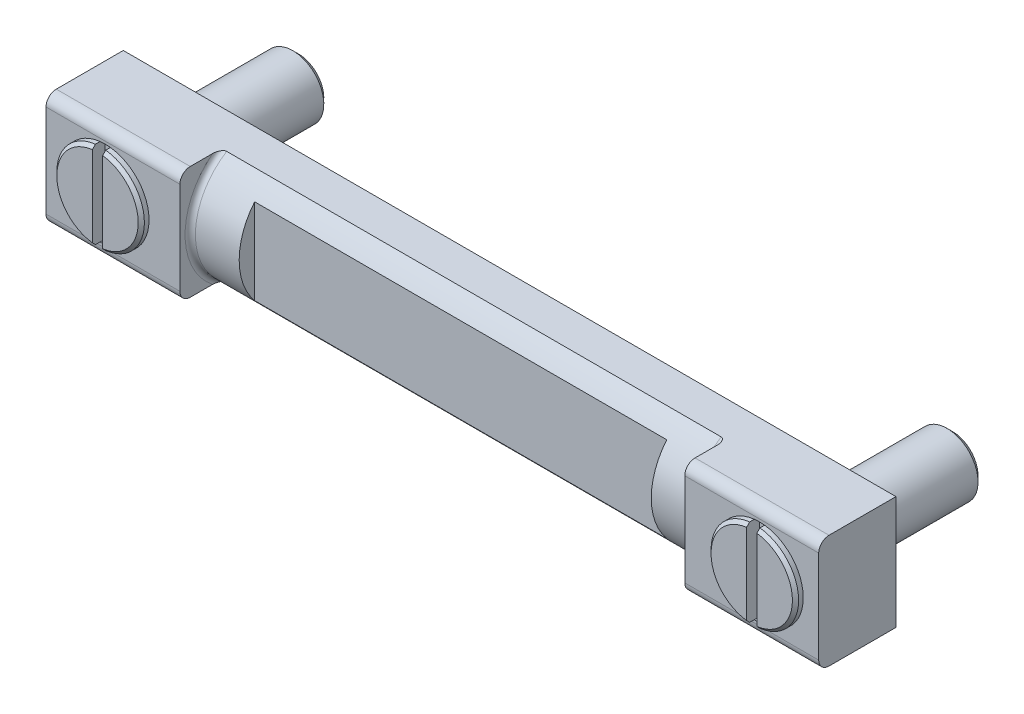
ISO-10303-21;
HEADER;
FILE_DESCRIPTION(('STEP AP214'),'2;1');
FILE_NAME('part.step','',(''),(''),'','','');
FILE_SCHEMA(('AUTOMOTIVE_DESIGN { 1 0 10303 214 1 1 1 1 }'));
ENDSEC;
DATA;
#1=APPLICATION_CONTEXT('core data for automotive mechanical design processes');
#2=APPLICATION_PROTOCOL_DEFINITION('international standard','automotive_design',2000,#1);
#3=PRODUCT_CONTEXT('',#1,'mechanical');
#4=PRODUCT('Part','Part','',(#3));
#5=PRODUCT_RELATED_PRODUCT_CATEGORY('part','',(#4));
#6=PRODUCT_DEFINITION_FORMATION('','',#4);
#7=PRODUCT_DEFINITION_CONTEXT('part definition',#1,'design');
#8=PRODUCT_DEFINITION('design','',#6,#7);
#9=PRODUCT_DEFINITION_SHAPE('','',#8);
#10=(LENGTH_UNIT() NAMED_UNIT(*) SI_UNIT(.MILLI.,.METRE.));
#11=(NAMED_UNIT(*) PLANE_ANGLE_UNIT() SI_UNIT($,.RADIAN.));
#12=(NAMED_UNIT(*) SI_UNIT($,.STERADIAN.) SOLID_ANGLE_UNIT());
#13=UNCERTAINTY_MEASURE_WITH_UNIT(LENGTH_MEASURE(1.E-05),#10,'distance_accuracy_value','');
#14=(GEOMETRIC_REPRESENTATION_CONTEXT(3) GLOBAL_UNCERTAINTY_ASSIGNED_CONTEXT((#13)) GLOBAL_UNIT_ASSIGNED_CONTEXT((#10,
#11,#12)) REPRESENTATION_CONTEXT('',''));
#15=CARTESIAN_POINT('',(0.,0.,0.));
#16=DIRECTION('',(0.,0.,1.));
#17=DIRECTION('',(1.,0.,0.));
#18=AXIS2_PLACEMENT_3D('',#15,#16,#17);
#19=CARTESIAN_POINT('',(24.,8.8,20.));
#20=DIRECTION('',(1.,0.,0.));
#21=DIRECTION('',(0.,0.,-1.));
#22=AXIS2_PLACEMENT_3D('',#19,#20,#21);
#23=PLANE('',#22);
#24=CARTESIAN_POINT('',(24.,0.,0.));
#25=DIRECTION('',(1.,0.,0.));
#26=DIRECTION('',(0.,0.,-1.));
#27=AXIS2_PLACEMENT_3D('',#24,#25,#26);
#28=CIRCLE('',#27,13.);
#29=CARTESIAN_POINT('',(24.,8.30662386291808,10.));
#30=VERTEX_POINT('',#29);
#31=CARTESIAN_POINT('',(24.,-8.30662386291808,10.));
#32=VERTEX_POINT('',#31);
#33=EDGE_CURVE('E315',#30,#32,#28,.T.);
#34=ORIENTED_EDGE('',*,*,#33,.T.);
#35=DIRECTION('',(0.,-1.,0.));
#36=VECTOR('',#35,1.);
#37=CARTESIAN_POINT('',(24.,8.8,10.));
#38=LINE('',#37,#36);
#39=EDGE_CURVE('E425',#30,#32,#38,.T.);
#40=ORIENTED_EDGE('',*,*,#39,.F.);
#41=EDGE_LOOP('',(#34,#40));
#42=FACE_BOUND('',#41,.T.);
#43=ADVANCED_FACE('F14',(#42),#23,.T.);
#44=CARTESIAN_POINT('',(63.5,0.,10.));
#45=DIRECTION('',(0.,0.,1.));
#46=DIRECTION('',(0.,1.,0.));
#47=AXIS2_PLACEMENT_3D('',#44,#45,#46);
#48=PLANE('',#47);
#49=DIRECTION('',(-1.,0.,0.));
#50=VECTOR('',#49,1.);
#51=CARTESIAN_POINT('',(-11.5,-8.30662386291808,10.));
#52=LINE('',#51,#50);
#53=CARTESIAN_POINT('',(104.,-8.30662386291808,10.));
#54=VERTEX_POINT('',#53);
#55=EDGE_CURVE('E433',#32,#54,#52,.F.);
#56=ORIENTED_EDGE('',*,*,#55,.T.);
#57=DIRECTION('',(0.,1.,0.));
#58=VECTOR('',#57,1.);
#59=CARTESIAN_POINT('',(104.,-8.8,10.));
#60=LINE('',#59,#58);
#61=CARTESIAN_POINT('',(104.,8.30662386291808,10.));
#62=VERTEX_POINT('',#61);
#63=EDGE_CURVE('E435',#54,#62,#60,.T.);
#64=ORIENTED_EDGE('',*,*,#63,.T.);
#65=DIRECTION('',(-1.,0.,0.));
#66=VECTOR('',#65,1.);
#67=CARTESIAN_POINT('',(-11.5,8.30662386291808,10.));
#68=LINE('',#67,#66);
#69=EDGE_CURVE('E312',#62,#30,#68,.T.);
#70=ORIENTED_EDGE('',*,*,#69,.T.);
#71=ORIENTED_EDGE('',*,*,#39,.T.);
#72=EDGE_LOOP('',(#56,#64,#70,#71));
#73=FACE_BOUND('',#72,.T.);
#74=ADVANCED_FACE('F413',(#73),#48,.T.);
#75=CARTESIAN_POINT('',(104.,-8.8,20.));
#76=DIRECTION('',(-1.,0.,0.));
#77=DIRECTION('',(0.,0.,1.));
#78=AXIS2_PLACEMENT_3D('',#75,#76,#77);
#79=PLANE('',#78);
#80=ORIENTED_EDGE('',*,*,#63,.F.);
#81=CARTESIAN_POINT('',(104.,0.,0.));
#82=DIRECTION('',(-1.,0.,0.));
#83=DIRECTION('',(0.,0.,1.));
#84=AXIS2_PLACEMENT_3D('',#81,#82,#83);
#85=CIRCLE('',#84,13.);
#86=EDGE_CURVE('E318',#54,#62,#85,.T.);
#87=ORIENTED_EDGE('',*,*,#86,.T.);
#88=EDGE_LOOP('',(#80,#87));
#89=FACE_BOUND('',#88,.T.);
#90=ADVANCED_FACE('F255',(#89),#79,.T.);
#91=CARTESIAN_POINT('',(-11.5,0.,0.));
#92=DIRECTION('',(-1.,0.,0.));
#93=DIRECTION('',(0.,0.,1.));
#94=AXIS2_PLACEMENT_3D('',#91,#92,#93);
#95=CYLINDRICAL_SURFACE('',#94,13.);
#96=DIRECTION('',(-1.,0.,0.));
#97=VECTOR('',#96,1.);
#98=CARTESIAN_POINT('',(-11.5,11.,6.92820323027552));
#99=LINE('',#98,#97);
#100=CARTESIAN_POINT('',(15.5,11.,6.92820323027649));
#101=VERTEX_POINT('',#100);
#102=CARTESIAN_POINT('',(111.5,11.,6.92820323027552));
#103=VERTEX_POINT('',#102);
#104=EDGE_CURVE('E241',#101,#103,#99,.F.);
#105=ORIENTED_EDGE('',*,*,#104,.F.);
#106=CARTESIAN_POINT('',(15.5,0.,0.));
#107=DIRECTION('',(-1.,0.,0.));
#108=DIRECTION('',(0.,0.,1.));
#109=AXIS2_PLACEMENT_3D('',#106,#107,#108);
#110=CIRCLE('',#109,13.);
#111=CARTESIAN_POINT('',(15.5,-11.,6.92820323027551));
#112=VERTEX_POINT('',#111);
#113=EDGE_CURVE('E441',#112,#101,#110,.T.);
#114=ORIENTED_EDGE('',*,*,#113,.F.);
#115=DIRECTION('',(-1.,0.,0.));
#116=VECTOR('',#115,1.);
#117=CARTESIAN_POINT('',(-11.5,-11.,6.92820323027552));
#118=LINE('',#117,#116);
#119=CARTESIAN_POINT('',(111.5,-11.,6.92820323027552));
#120=VERTEX_POINT('',#119);
#121=EDGE_CURVE('E268',#120,#112,#118,.T.);
#122=ORIENTED_EDGE('',*,*,#121,.F.);
#123=CARTESIAN_POINT('',(111.5,0.,0.));
#124=DIRECTION('',(-1.,0.,0.));
#125=DIRECTION('',(0.,0.,1.));
#126=AXIS2_PLACEMENT_3D('',#123,#124,#125);
#127=CIRCLE('',#126,13.);
#128=EDGE_CURVE('E446',#120,#103,#127,.T.);
#129=ORIENTED_EDGE('',*,*,#128,.T.);
#130=EDGE_LOOP('',(#105,#114,#122,#129));
#131=FACE_BOUND('',#130,.T.);
#132=ORIENTED_EDGE('',*,*,#86,.F.);
#133=ORIENTED_EDGE('',*,*,#55,.F.);
#134=ORIENTED_EDGE('',*,*,#33,.F.);
#135=ORIENTED_EDGE('',*,*,#69,.F.);
#136=EDGE_LOOP('',(#132,#133,#134,#135));
#137=FACE_BOUND('',#136,.T.);
#138=ADVANCED_FACE('F253',(#131,#137),#95,.T.);
#139=CARTESIAN_POINT('',(15.5,0.,0.));
#140=DIRECTION('',(-1.,0.,0.));
#141=DIRECTION('',(0.,0.,1.));
#142=AXIS2_PLACEMENT_3D('',#139,#140,#141);
#143=TOROIDAL_SURFACE('',#142,14.,1.);
#144=ORIENTED_EDGE('',*,*,#113,.T.);
#145=CARTESIAN_POINT('',(15.4978442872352,11.,6.92820759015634));
#146=CARTESIAN_POINT('',(15.5297843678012,11.,6.92808298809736));
#147=CARTESIAN_POINT('',(15.5617700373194,11.,6.930852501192));
#148=CARTESIAN_POINT('',(15.6247871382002,11.,6.94190896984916));
#149=CARTESIAN_POINT('',(15.6558167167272,11.,6.95020601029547));
#150=CARTESIAN_POINT('',(15.7230937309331,11.,6.97402353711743));
#151=CARTESIAN_POINT('',(15.758905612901,11.,6.99076431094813));
#152=CARTESIAN_POINT('',(15.8273438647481,11.,7.02979203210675));
#153=CARTESIAN_POINT('',(15.8599644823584,11.,7.05208874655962));
#154=CARTESIAN_POINT('',(15.9385569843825,11.,7.11378606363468));
#155=CARTESIAN_POINT('',(15.9823359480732,11.,7.15595567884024));
#156=CARTESIAN_POINT('',(16.0630877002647,11.,7.24633689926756));
#157=CARTESIAN_POINT('',(16.1000435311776,11.,7.29456307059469));
#158=CARTESIAN_POINT('',(16.1633834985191,11.,7.38809767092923));
#159=CARTESIAN_POINT('',(16.1905222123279,11.,7.43290339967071));
#160=CARTESIAN_POINT('',(16.2408755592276,11.,7.52467977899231));
#161=CARTESIAN_POINT('',(16.264087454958,11.,7.57165191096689));
#162=CARTESIAN_POINT('',(16.3284555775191,11.,7.7151096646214));
#163=CARTESIAN_POINT('',(16.3642723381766,11.,7.81402440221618));
#164=CARTESIAN_POINT('',(16.414737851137,11.,7.98626151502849));
#165=CARTESIAN_POINT('',(16.4325126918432,11.,8.05871959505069));
#166=CARTESIAN_POINT('',(16.4619294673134,11.,8.20492108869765));
#167=CARTESIAN_POINT('',(16.4735685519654,11.,8.27866508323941));
#168=CARTESIAN_POINT('',(16.4907296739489,11.,8.4268394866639));
#169=CARTESIAN_POINT('',(16.4962532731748,11.,8.50126971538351));
#170=CARTESIAN_POINT('',(16.5010309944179,11.,8.65029626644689));
#171=CARTESIAN_POINT('',(16.5002876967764,11.,8.72489250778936));
#172=CARTESIAN_POINT('',(16.4901579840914,11.,8.91190764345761));
#173=CARTESIAN_POINT('',(16.4765405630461,11.,9.02413393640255));
#174=CARTESIAN_POINT('',(16.4323945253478,11.,9.24516335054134));
#175=CARTESIAN_POINT('',(16.4019037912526,11.,9.3539735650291));
#176=CARTESIAN_POINT('',(16.3352075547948,11.,9.52755005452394));
#177=CARTESIAN_POINT('',(16.3046648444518,11.,9.59448799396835));
#178=CARTESIAN_POINT('',(16.2341242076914,11.,9.72324485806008));
#179=CARTESIAN_POINT('',(16.1941382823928,11.,9.7850701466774));
#180=CARTESIAN_POINT('',(16.1153741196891,11.,9.88582041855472));
#181=CARTESIAN_POINT('',(16.0789176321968,11.,9.92655135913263));
#182=CARTESIAN_POINT('',(16.0000492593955,11.,10.0018054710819));
#183=CARTESIAN_POINT('',(15.9576462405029,11.,10.0363377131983));
#184=CARTESIAN_POINT('',(15.8766652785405,11.,10.0906403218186));
#185=CARTESIAN_POINT('',(15.8391502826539,11.,10.1119877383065));
#186=CARTESIAN_POINT('',(15.7611021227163,11.,10.1482304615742));
#187=CARTESIAN_POINT('',(15.7205709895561,11.,10.1631300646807));
#188=CARTESIAN_POINT('',(15.637180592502,11.,10.1854728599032));
#189=CARTESIAN_POINT('',(15.5943076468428,11.,10.1928658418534));
#190=CARTESIAN_POINT('',(15.507938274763,11.,10.1993652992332));
#191=CARTESIAN_POINT('',(15.46444210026,11.,10.1984750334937));
#192=CARTESIAN_POINT('',(15.3830026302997,11.,10.1890390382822));
#193=CARTESIAN_POINT('',(15.3449601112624,11.,10.1813161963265));
#194=CARTESIAN_POINT('',(15.2706207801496,11.,10.1598700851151));
#195=CARTESIAN_POINT('',(15.2343242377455,11.,10.1461458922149));
#196=CARTESIAN_POINT('',(15.1625265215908,11.,10.1127244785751));
#197=CARTESIAN_POINT('',(15.1271433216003,11.,10.0927763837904));
#198=CARTESIAN_POINT('',(15.059495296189,11.,10.0481849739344));
#199=CARTESIAN_POINT('',(15.0272321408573,11.,10.0235391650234));
#200=CARTESIAN_POINT('',(14.9482353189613,11.,9.95510762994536));
#201=CARTESIAN_POINT('',(14.9039383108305,11.,9.90850182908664));
#202=CARTESIAN_POINT('',(14.8232940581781,11.,9.80884564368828));
#203=CARTESIAN_POINT('',(14.7869681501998,11.,9.755778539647));
#204=CARTESIAN_POINT('',(14.7062699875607,11.,9.61924298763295));
#205=CARTESIAN_POINT('',(14.6661900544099,11.,9.53324563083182));
#206=CARTESIAN_POINT('',(14.5998732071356,11.,9.3561730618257));
#207=CARTESIAN_POINT('',(14.57365687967,11.,9.26509051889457));
#208=CARTESIAN_POINT('',(14.5243999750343,11.,9.03950694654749));
#209=CARTESIAN_POINT('',(14.5078704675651,11.,8.90358902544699));
#210=CARTESIAN_POINT('',(14.4965373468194,11.,8.63064489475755));
#211=CARTESIAN_POINT('',(14.5017921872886,11.,8.49361668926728));
#212=CARTESIAN_POINT('',(14.5252133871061,11.,8.28811130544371));
#213=CARTESIAN_POINT('',(14.5358589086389,11.,8.21870059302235));
#214=CARTESIAN_POINT('',(14.5625849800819,11.,8.08094180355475));
#215=CARTESIAN_POINT('',(14.5786633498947,11.,8.01259331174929));
#216=CARTESIAN_POINT('',(14.6163615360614,11.,7.87771443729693));
#217=CARTESIAN_POINT('',(14.6379601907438,11.,7.8111781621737));
#218=CARTESIAN_POINT('',(14.6871024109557,11.,7.68037539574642));
#219=CARTESIAN_POINT('',(14.7146404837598,11.,7.61610687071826));
#220=CARTESIAN_POINT('',(14.7722004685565,11.,7.49920324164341));
#221=CARTESIAN_POINT('',(14.8013945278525,11.,7.44616357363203));
#222=CARTESIAN_POINT('',(14.8654836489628,11.,7.34343825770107));
#223=CARTESIAN_POINT('',(14.9003895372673,11.,7.29375923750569));
#224=CARTESIAN_POINT('',(14.9772632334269,11.,7.19893330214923));
#225=CARTESIAN_POINT('',(15.0193232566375,11.,7.15385975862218));
#226=CARTESIAN_POINT('',(15.1111086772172,11.,7.07231173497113));
#227=CARTESIAN_POINT('',(15.1607948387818,11.,7.03579553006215));
#228=CARTESIAN_POINT('',(15.243397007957,11.,6.989951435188));
#229=CARTESIAN_POINT('',(15.2736403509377,11.,6.97581620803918));
#230=CARTESIAN_POINT('',(15.3359951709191,11.,6.95263352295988));
#231=CARTESIAN_POINT('',(15.3681013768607,11.,6.94357241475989));
#232=CARTESIAN_POINT('',(15.4167385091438,11.,6.93447174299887));
#233=CARTESIAN_POINT('',(15.4328702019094,11.,6.93218788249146));
#234=CARTESIAN_POINT('',(15.4652787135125,11.,6.92908737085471));
#235=CARTESIAN_POINT('',(15.481555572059,11.,6.92827113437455));
#236=CARTESIAN_POINT('',(15.4978442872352,11.,6.92820759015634));
#237=B_SPLINE_CURVE_WITH_KNOTS('',3,(#145,#146,#147,#148,#149,#150,#151,#152,#153,#154,#155,
#156,#157,#158,#159,#160,#161,#162,#163,#164,#165,#166,#167,#168,#169,#170,#171,#172,#173,#174,
#175,#176,#177,#178,#179,#180,#181,#182,#183,#184,#185,#186,#187,#188,#189,#190,#191,#192,#193,
#194,#195,#196,#197,#198,#199,#200,#201,#202,#203,#204,#205,#206,#207,#208,#209,#210,#211,#212,
#213,#214,#215,#216,#217,#218,#219,#220,#221,#222,#223,#224,#225,#226,#227,#228,#229,#230,#231,
#232,#233,#234,#235,#236),.UNSPECIFIED.,.T.,.F.,(4,2,2,2,2,2,2,2,2,2,2,2,2,2,2,2,2,2,2,2,2,2,2,
2,2,2,2,2,2,2,2,2,2,2,2,2,2,2,2,2,2,2,2,2,2,4),(0.,0.0957545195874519,0.191684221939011,
0.309616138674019,0.427756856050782,0.609097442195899,0.790882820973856,0.947811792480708,
1.10484971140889,1.41932120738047,1.64292009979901,1.86662276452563,2.09026828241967,
2.31382172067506,2.65185099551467,2.98912441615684,3.20925847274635,3.42911425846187,
3.59256840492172,3.75578137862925,3.88476354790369,4.01365964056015,4.14341232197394,
4.27311395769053,4.38904398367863,4.50499185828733,4.62640063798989,4.74787404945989,
4.93967606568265,5.13198538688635,5.41504540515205,5.69852457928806,6.1071472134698,
6.51686700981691,6.7273568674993,6.93776235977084,7.14737306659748,7.35679075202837,
7.53813490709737,7.71982685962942,7.9040681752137,8.08739153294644,8.18719455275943,
8.28672777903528,8.33554661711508,8.38437924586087),.UNSPECIFIED.);
#238=CARTESIAN_POINT('',(14.5,11.,8.6602540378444));
#239=VERTEX_POINT('',#238);
#240=EDGE_CURVE('E233',#239,#101,#237,.T.);
#241=ORIENTED_EDGE('',*,*,#240,.F.);
#242=CARTESIAN_POINT('',(14.5,0.,0.));
#243=DIRECTION('',(-1.,0.,0.));
#244=DIRECTION('',(0.,0.,1.));
#245=AXIS2_PLACEMENT_3D('',#242,#243,#244);
#246=CIRCLE('',#245,14.);
#247=CARTESIAN_POINT('',(14.5,-11.,8.6602540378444));
#248=VERTEX_POINT('',#247);
#249=EDGE_CURVE('E438',#248,#239,#246,.T.);
#250=ORIENTED_EDGE('',*,*,#249,.F.);
#251=CARTESIAN_POINT('',(15.4978442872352,-11.,6.92820759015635));
#252=CARTESIAN_POINT('',(15.4657722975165,-11.,6.92834195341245));
#253=CARTESIAN_POINT('',(15.4336791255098,-11.,6.93139467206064));
#254=CARTESIAN_POINT('',(15.3704990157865,-11.,6.94303480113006));
#255=CARTESIAN_POINT('',(15.3394140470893,-11.,6.95163242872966));
#256=CARTESIAN_POINT('',(15.2718954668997,-11.,6.97617131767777));
#257=CARTESIAN_POINT('',(15.2359201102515,-11.,6.99336300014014));
#258=CARTESIAN_POINT('',(15.1672234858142,-11.,7.03330333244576));
#259=CARTESIAN_POINT('',(15.1345081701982,-11.,7.0560618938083));
#260=CARTESIAN_POINT('',(15.0555219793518,-11.,7.11909217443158));
#261=CARTESIAN_POINT('',(15.011511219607,-11.,7.16217147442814));
#262=CARTESIAN_POINT('',(14.9304230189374,-11.,7.2543866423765));
#263=CARTESIAN_POINT('',(14.893362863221,-11.,7.30353711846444));
#264=CARTESIAN_POINT('',(14.8299141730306,-11.,7.39880429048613));
#265=CARTESIAN_POINT('',(14.8027594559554,-11.,7.44441893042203));
#266=CARTESIAN_POINT('',(14.7524422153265,-11.,7.53781102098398));
#267=CARTESIAN_POINT('',(14.7292824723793,-11.,7.58558994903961));
#268=CARTESIAN_POINT('',(14.6651679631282,-11.,7.73146510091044));
#269=CARTESIAN_POINT('',(14.6296496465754,-11.,7.83198585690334));
#270=CARTESIAN_POINT('',(14.5801652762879,-11.,8.00610227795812));
#271=CARTESIAN_POINT('',(14.5629311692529,-11.,8.07882300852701));
#272=CARTESIAN_POINT('',(14.5346063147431,-11.,8.22550232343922));
#273=CARTESIAN_POINT('',(14.5235183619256,-11.,8.29946145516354));
#274=CARTESIAN_POINT('',(14.507488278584,-11.,8.44801311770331));
#275=CARTESIAN_POINT('',(14.5025439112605,-11.,8.52260540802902));
#276=CARTESIAN_POINT('',(14.4989684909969,-11.,8.67190631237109));
#277=CARTESIAN_POINT('',(14.5003347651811,-11.,8.74661486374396));
#278=CARTESIAN_POINT('',(14.512001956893,-11.,8.93213765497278));
#279=CARTESIAN_POINT('',(14.5263475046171,-11.,9.04273202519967));
#280=CARTESIAN_POINT('',(14.5716188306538,-11.,9.26043296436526));
#281=CARTESIAN_POINT('',(14.602508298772,-11.,9.36754662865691));
#282=CARTESIAN_POINT('',(14.669711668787,-11.,9.5387706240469));
#283=CARTESIAN_POINT('',(14.7005330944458,-11.,9.60503182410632));
#284=CARTESIAN_POINT('',(14.7715561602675,-11.,9.73238336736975));
#285=CARTESIAN_POINT('',(14.8117457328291,-11.,9.79348022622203));
#286=CARTESIAN_POINT('',(14.8907342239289,-11.,9.89286769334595));
#287=CARTESIAN_POINT('',(14.9272285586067,-11.,9.93298076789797));
#288=CARTESIAN_POINT('',(15.0060792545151,-11.,10.0069953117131));
#289=CARTESIAN_POINT('',(15.0484269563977,-11.,10.0409057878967));
#290=CARTESIAN_POINT('',(15.129337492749,-11.,10.094209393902));
#291=CARTESIAN_POINT('',(15.1668726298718,-11.,10.1151544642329));
#292=CARTESIAN_POINT('',(15.2448970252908,-11.,10.150585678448));
#293=CARTESIAN_POINT('',(15.2853842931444,-11.,10.1650761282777));
#294=CARTESIAN_POINT('',(15.3686029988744,-11.,10.1866165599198));
#295=CARTESIAN_POINT('',(15.4113472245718,-11.,10.1936179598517));
#296=CARTESIAN_POINT('',(15.4973879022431,-11.,10.1993955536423));
#297=CARTESIAN_POINT('',(15.5406841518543,-11.,10.1981746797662));
#298=CARTESIAN_POINT('',(15.6218263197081,-11.,10.1881816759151));
#299=CARTESIAN_POINT('',(15.6597735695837,-11.,10.1802018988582));
#300=CARTESIAN_POINT('',(15.7338909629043,-11.,10.1582835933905));
#301=CARTESIAN_POINT('',(15.7700608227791,-11.,10.1443441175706));
#302=CARTESIAN_POINT('',(15.8417182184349,-11.,10.1104649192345));
#303=CARTESIAN_POINT('',(15.8770770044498,-11.,10.0902555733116));
#304=CARTESIAN_POINT('',(15.9446480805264,-11.,10.0451576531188));
#305=CARTESIAN_POINT('',(15.9768586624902,-11.,10.0202665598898));
#306=CARTESIAN_POINT('',(16.0558549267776,-11.,9.95108580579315));
#307=CARTESIAN_POINT('',(16.1001621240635,-11.,9.90395862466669));
#308=CARTESIAN_POINT('',(16.1807485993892,-11.,9.80326729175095));
#309=CARTESIAN_POINT('',(16.2170062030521,-11.,9.74968634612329));
#310=CARTESIAN_POINT('',(16.2974971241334,-11.,9.61183873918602));
#311=CARTESIAN_POINT('',(16.337390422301,-11.,9.52504584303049));
#312=CARTESIAN_POINT('',(16.4032136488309,-11.,9.34642356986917));
#313=CARTESIAN_POINT('',(16.4291231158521,-11.,9.25458702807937));
#314=CARTESIAN_POINT('',(16.4774430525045,-11.,9.02750656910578));
#315=CARTESIAN_POINT('',(16.4933411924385,-11.,8.89088151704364));
#316=CARTESIAN_POINT('',(16.5032888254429,-11.,8.61661735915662));
#317=CARTESIAN_POINT('',(16.497278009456,-11.,8.47897649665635));
#318=CARTESIAN_POINT('',(16.4725857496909,-11.,8.27269141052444));
#319=CARTESIAN_POINT('',(16.4614925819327,-11.,8.20306224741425));
#320=CARTESIAN_POINT('',(16.4338194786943,-11.,8.06491154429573));
#321=CARTESIAN_POINT('',(16.4172418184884,-11.,7.99638955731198));
#322=CARTESIAN_POINT('',(16.3784808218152,-11.,7.86123325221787));
#323=CARTESIAN_POINT('',(16.3563196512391,-11.,7.79459260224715));
#324=CARTESIAN_POINT('',(16.305962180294,-11.,7.66367030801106));
#325=CARTESIAN_POINT('',(16.2777717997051,-11.,7.59938642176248));
#326=CARTESIAN_POINT('',(16.2195853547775,-11.,7.48399393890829));
#327=CARTESIAN_POINT('',(16.1905624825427,-11.,7.43239796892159));
#328=CARTESIAN_POINT('',(16.1270068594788,-11.,7.33252253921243));
#329=CARTESIAN_POINT('',(16.0924643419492,-11.,7.28424917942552));
#330=CARTESIAN_POINT('',(16.0165727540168,-11.,7.19217422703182));
#331=CARTESIAN_POINT('',(15.9751375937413,-11.,7.148442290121));
#332=CARTESIAN_POINT('',(15.8849186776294,-11.,7.06932707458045));
#333=CARTESIAN_POINT('',(15.8361702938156,-11.,7.03390560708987));
#334=CARTESIAN_POINT('',(15.7547148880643,-11.,6.98902369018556));
#335=CARTESIAN_POINT('',(15.7245140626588,-11.,6.97502313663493));
#336=CARTESIAN_POINT('',(15.6622650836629,-11.,6.9520990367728));
#337=CARTESIAN_POINT('',(15.6302220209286,-11.,6.943162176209));
#338=CARTESIAN_POINT('',(15.5812096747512,-11.,6.93414052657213));
#339=CARTESIAN_POINT('',(15.5646244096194,-11.,6.93186371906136));
#340=CARTESIAN_POINT('',(15.5313094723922,-11.,6.92886199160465));
#341=CARTESIAN_POINT('',(15.5145797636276,-11.,6.92813747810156));
#342=CARTESIAN_POINT('',(15.4978442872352,-11.,6.92820759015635));
#343=B_SPLINE_CURVE_WITH_KNOTS('',3,(#251,#252,#253,#254,#255,#256,#257,#258,#259,#260,#261,
#262,#263,#264,#265,#266,#267,#268,#269,#270,#271,#272,#273,#274,#275,#276,#277,#278,#279,#280,
#281,#282,#283,#284,#285,#286,#287,#288,#289,#290,#291,#292,#293,#294,#295,#296,#297,#298,#299,
#300,#301,#302,#303,#304,#305,#306,#307,#308,#309,#310,#311,#312,#313,#314,#315,#316,#317,#318,
#319,#320,#321,#322,#323,#324,#325,#326,#327,#328,#329,#330,#331,#332,#333,#334,#335,#336,#337,
#338,#339,#340,#341,#342),.UNSPECIFIED.,.T.,.F.,(4,2,2,2,2,2,2,2,2,2,2,2,2,2,2,2,2,2,2,2,2,2,2,
2,2,2,2,2,2,2,2,2,2,2,2,2,2,2,2,2,2,2,2,2,2,4),(0.,0.0961483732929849,0.192474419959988,
0.311421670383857,0.430582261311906,0.614309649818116,0.798488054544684,0.957519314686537,
1.11666082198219,1.43534321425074,1.65932980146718,1.88341815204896,2.10742489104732,
2.33133676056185,2.66480915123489,2.99755262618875,3.21619284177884,3.43455295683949,
3.59670958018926,3.75862883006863,3.88707077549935,4.01542690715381,4.1446107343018,
4.27374849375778,4.38955823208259,4.50538638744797,4.62711842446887,4.74891614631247,
4.94186873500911,5.1353347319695,5.42031495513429,5.70571104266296,6.1162107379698,
6.52784127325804,6.7391832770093,6.95043771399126,7.16086635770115,7.37108933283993,
7.54840931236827,7.7260465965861,7.90609701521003,8.0853030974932,8.18482015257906,
8.28407431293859,8.33423233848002,8.38440349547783),.UNSPECIFIED.);
#344=EDGE_CURVE('E260',#112,#248,#343,.T.);
#345=ORIENTED_EDGE('',*,*,#344,.F.);
#346=EDGE_LOOP('',(#144,#241,#250,#345));
#347=FACE_BOUND('',#346,.T.);
#348=ADVANCED_FACE('F247',(#347),#143,.F.);
#349=CARTESIAN_POINT('',(111.5,0.,0.));
#350=DIRECTION('',(-1.,0.,0.));
#351=DIRECTION('',(0.,0.,1.));
#352=AXIS2_PLACEMENT_3D('',#349,#350,#351);
#353=TOROIDAL_SURFACE('',#352,14.,1.);
#354=CARTESIAN_POINT('',(112.5,0.,0.));
#355=DIRECTION('',(-1.,0.,0.));
#356=DIRECTION('',(0.,0.,1.));
#357=AXIS2_PLACEMENT_3D('',#354,#355,#356);
#358=CIRCLE('',#357,14.);
#359=CARTESIAN_POINT('',(112.5,-11.,8.66025403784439));
#360=VERTEX_POINT('',#359);
#361=CARTESIAN_POINT('',(112.5,11.,8.66025403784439));
#362=VERTEX_POINT('',#361);
#363=EDGE_CURVE('E269',#360,#362,#358,.T.);
#364=ORIENTED_EDGE('',*,*,#363,.T.);
#365=CARTESIAN_POINT('',(111.502155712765,11.,6.92820759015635));
#366=CARTESIAN_POINT('',(111.534227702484,11.,6.92834195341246));
#367=CARTESIAN_POINT('',(111.56632087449,11.,6.93139467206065));
#368=CARTESIAN_POINT('',(111.629500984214,11.,6.94303480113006));
#369=CARTESIAN_POINT('',(111.660585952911,11.,6.95163242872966));
#370=CARTESIAN_POINT('',(111.7281045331,11.,6.97617131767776));
#371=CARTESIAN_POINT('',(111.764079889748,11.,6.99336300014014));
#372=CARTESIAN_POINT('',(111.832776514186,11.,7.03330333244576));
#373=CARTESIAN_POINT('',(111.865491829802,11.,7.05606189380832));
#374=CARTESIAN_POINT('',(111.944478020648,11.,7.11909217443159));
#375=CARTESIAN_POINT('',(111.988488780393,11.,7.1621714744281));
#376=CARTESIAN_POINT('',(112.069576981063,11.,7.25438664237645));
#377=CARTESIAN_POINT('',(112.106637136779,11.,7.30353711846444));
#378=CARTESIAN_POINT('',(112.170085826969,11.,7.39880429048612));
#379=CARTESIAN_POINT('',(112.197240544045,11.,7.44441893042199));
#380=CARTESIAN_POINT('',(112.247557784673,11.,7.53781102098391));
#381=CARTESIAN_POINT('',(112.270717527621,11.,7.58558994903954));
#382=CARTESIAN_POINT('',(112.334832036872,11.,7.73146510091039));
#383=CARTESIAN_POINT('',(112.370350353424,11.,7.83198585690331));
#384=CARTESIAN_POINT('',(112.419834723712,11.,8.00610227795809));
#385=CARTESIAN_POINT('',(112.437068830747,11.,8.07882300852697));
#386=CARTESIAN_POINT('',(112.465393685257,11.,8.22550232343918));
#387=CARTESIAN_POINT('',(112.476481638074,11.,8.2994614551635));
#388=CARTESIAN_POINT('',(112.492511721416,11.,8.44801311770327));
#389=CARTESIAN_POINT('',(112.49745608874,11.,8.52260540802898));
#390=CARTESIAN_POINT('',(112.501031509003,11.,8.67190631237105));
#391=CARTESIAN_POINT('',(112.499665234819,11.,8.74661486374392));
#392=CARTESIAN_POINT('',(112.487998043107,11.,8.93213765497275));
#393=CARTESIAN_POINT('',(112.473652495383,11.,9.04273202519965));
#394=CARTESIAN_POINT('',(112.428381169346,11.,9.26043296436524));
#395=CARTESIAN_POINT('',(112.397491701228,11.,9.36754662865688));
#396=CARTESIAN_POINT('',(112.330288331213,11.,9.53877062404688));
#397=CARTESIAN_POINT('',(112.299466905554,11.,9.60503182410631));
#398=CARTESIAN_POINT('',(112.228443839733,11.,9.73238336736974));
#399=CARTESIAN_POINT('',(112.188254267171,11.,9.79348022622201));
#400=CARTESIAN_POINT('',(112.109265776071,11.,9.89286769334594));
#401=CARTESIAN_POINT('',(112.072771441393,11.,9.932980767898));
#402=CARTESIAN_POINT('',(111.993920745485,11.,10.0069953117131));
#403=CARTESIAN_POINT('',(111.951573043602,11.,10.0409057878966));
#404=CARTESIAN_POINT('',(111.870662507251,11.,10.094209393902));
#405=CARTESIAN_POINT('',(111.833127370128,11.,10.1151544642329));
#406=CARTESIAN_POINT('',(111.755102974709,11.,10.150585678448));
#407=CARTESIAN_POINT('',(111.714615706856,11.,10.1650761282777));
#408=CARTESIAN_POINT('',(111.631397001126,11.,10.1866165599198));
#409=CARTESIAN_POINT('',(111.588652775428,11.,10.1936179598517));
#410=CARTESIAN_POINT('',(111.502612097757,11.,10.1993955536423));
#411=CARTESIAN_POINT('',(111.459315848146,11.,10.1981746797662));
#412=CARTESIAN_POINT('',(111.378173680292,11.,10.1881816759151));
#413=CARTESIAN_POINT('',(111.340226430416,11.,10.1802018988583));
#414=CARTESIAN_POINT('',(111.266109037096,11.,10.1582835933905));
#415=CARTESIAN_POINT('',(111.229939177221,11.,10.1443441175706));
#416=CARTESIAN_POINT('',(111.158281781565,11.,10.1104649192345));
#417=CARTESIAN_POINT('',(111.12292299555,11.,10.0902555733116));
#418=CARTESIAN_POINT('',(111.055351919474,11.,10.0451576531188));
#419=CARTESIAN_POINT('',(111.02314133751,11.,10.0202665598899));
#420=CARTESIAN_POINT('',(110.944145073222,11.,9.95108580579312));
#421=CARTESIAN_POINT('',(110.899837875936,11.,9.90395862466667));
#422=CARTESIAN_POINT('',(110.819251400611,11.,9.80326729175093));
#423=CARTESIAN_POINT('',(110.782993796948,11.,9.74968634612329));
#424=CARTESIAN_POINT('',(110.702502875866,11.,9.611838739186));
#425=CARTESIAN_POINT('',(110.662609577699,11.,9.52504584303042));
#426=CARTESIAN_POINT('',(110.596786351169,11.,9.34642356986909));
#427=CARTESIAN_POINT('',(110.570876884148,11.,9.25458702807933));
#428=CARTESIAN_POINT('',(110.522556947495,11.,9.02750656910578));
#429=CARTESIAN_POINT('',(110.506658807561,11.,8.89088151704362));
#430=CARTESIAN_POINT('',(110.496711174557,11.,8.61661735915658));
#431=CARTESIAN_POINT('',(110.502721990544,11.,8.47897649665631));
#432=CARTESIAN_POINT('',(110.527414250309,11.,8.2726914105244));
#433=CARTESIAN_POINT('',(110.538507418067,11.,8.20306224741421));
#434=CARTESIAN_POINT('',(110.566180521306,11.,8.06491154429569));
#435=CARTESIAN_POINT('',(110.582758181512,11.,7.99638955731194));
#436=CARTESIAN_POINT('',(110.621519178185,11.,7.86123325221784));
#437=CARTESIAN_POINT('',(110.643680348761,11.,7.79459260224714));
#438=CARTESIAN_POINT('',(110.694037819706,11.,7.66367030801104));
#439=CARTESIAN_POINT('',(110.722228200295,11.,7.59938642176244));
#440=CARTESIAN_POINT('',(110.780414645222,11.,7.48399393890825));
#441=CARTESIAN_POINT('',(110.809437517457,11.,7.43239796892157));
#442=CARTESIAN_POINT('',(110.872993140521,11.,7.33252253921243));
#443=CARTESIAN_POINT('',(110.907535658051,11.,7.28424917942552));
#444=CARTESIAN_POINT('',(110.983427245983,11.,7.1921742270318));
#445=CARTESIAN_POINT('',(111.024862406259,11.,7.14844229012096));
#446=CARTESIAN_POINT('',(111.115081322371,11.,7.06932707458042));
#447=CARTESIAN_POINT('',(111.163829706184,11.,7.03390560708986));
#448=CARTESIAN_POINT('',(111.245285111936,11.,6.98902369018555));
#449=CARTESIAN_POINT('',(111.275485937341,11.,6.97502313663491));
#450=CARTESIAN_POINT('',(111.337734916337,11.,6.95209903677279));
#451=CARTESIAN_POINT('',(111.369777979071,11.,6.94316217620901));
#452=CARTESIAN_POINT('',(111.418790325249,11.,6.93414052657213));
#453=CARTESIAN_POINT('',(111.435375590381,11.,6.93186371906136));
#454=CARTESIAN_POINT('',(111.468690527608,11.,6.92886199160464));
#455=CARTESIAN_POINT('',(111.485420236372,11.,6.92813747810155));
#456=CARTESIAN_POINT('',(111.502155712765,11.,6.92820759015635));
#457=B_SPLINE_CURVE_WITH_KNOTS('',3,(#365,#366,#367,#368,#369,#370,#371,#372,#373,#374,#375,
#376,#377,#378,#379,#380,#381,#382,#383,#384,#385,#386,#387,#388,#389,#390,#391,#392,#393,#394,
#395,#396,#397,#398,#399,#400,#401,#402,#403,#404,#405,#406,#407,#408,#409,#410,#411,#412,#413,
#414,#415,#416,#417,#418,#419,#420,#421,#422,#423,#424,#425,#426,#427,#428,#429,#430,#431,#432,
#433,#434,#435,#436,#437,#438,#439,#440,#441,#442,#443,#444,#445,#446,#447,#448,#449,#450,#451,
#452,#453,#454,#455,#456),.UNSPECIFIED.,.T.,.F.,(4,2,2,2,2,2,2,2,2,2,2,2,2,2,2,2,2,2,2,2,2,2,2,
2,2,2,2,2,2,2,2,2,2,2,2,2,2,2,2,2,2,2,2,2,2,4),(0.,0.0961483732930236,0.192474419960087,
0.311421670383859,0.430582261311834,0.614309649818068,0.798488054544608,0.957519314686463,
1.11666082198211,1.43534321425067,1.65932980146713,1.8834181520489,2.10742489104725,
2.3313367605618,2.66480915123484,2.9975526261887,3.2161928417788,3.43455295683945,
3.59670958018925,3.75862883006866,3.88707077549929,4.01542690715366,4.14461073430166,
4.27374849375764,4.38955823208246,4.50538638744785,4.62711842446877,4.74891614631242,
4.94186873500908,5.13533473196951,5.42031495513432,5.70571104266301,6.11621073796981,
6.52784127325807,6.73918327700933,6.9504377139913,7.16086635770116,7.37108933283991,
7.54840931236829,7.72604659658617,7.90609701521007,8.08530309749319,8.18482015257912,
8.28407431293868,8.33423233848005,8.38440349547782),.UNSPECIFIED.);
#458=EDGE_CURVE('E300',#103,#362,#457,.T.);
#459=ORIENTED_EDGE('',*,*,#458,.F.);
#460=ORIENTED_EDGE('',*,*,#128,.F.);
#461=CARTESIAN_POINT('',(111.502155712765,-11.,6.92820759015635));
#462=CARTESIAN_POINT('',(111.470215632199,-11.,6.92808298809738));
#463=CARTESIAN_POINT('',(111.438229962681,-11.,6.93085250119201));
#464=CARTESIAN_POINT('',(111.3752128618,-11.,6.94190896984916));
#465=CARTESIAN_POINT('',(111.344183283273,-11.,6.95020601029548));
#466=CARTESIAN_POINT('',(111.276906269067,-11.,6.97402353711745));
#467=CARTESIAN_POINT('',(111.241094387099,-11.,6.99076431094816));
#468=CARTESIAN_POINT('',(111.172656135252,-11.,7.02979203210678));
#469=CARTESIAN_POINT('',(111.140035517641,-11.,7.05208874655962));
#470=CARTESIAN_POINT('',(111.061443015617,-11.,7.11378606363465));
#471=CARTESIAN_POINT('',(111.017664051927,-11.,7.15595567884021));
#472=CARTESIAN_POINT('',(110.936912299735,-11.,7.24633689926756));
#473=CARTESIAN_POINT('',(110.899956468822,-11.,7.2945630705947));
#474=CARTESIAN_POINT('',(110.836616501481,-11.,7.38809767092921));
#475=CARTESIAN_POINT('',(110.809477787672,-11.,7.43290339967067));
#476=CARTESIAN_POINT('',(110.759124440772,-11.,7.52467977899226));
#477=CARTESIAN_POINT('',(110.735912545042,-11.,7.57165191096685));
#478=CARTESIAN_POINT('',(110.671544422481,-11.,7.71510966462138));
#479=CARTESIAN_POINT('',(110.635727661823,-11.,7.81402440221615));
#480=CARTESIAN_POINT('',(110.585262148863,-11.,7.98626151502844));
#481=CARTESIAN_POINT('',(110.567487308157,-11.,8.05871959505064));
#482=CARTESIAN_POINT('',(110.538070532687,-11.,8.20492108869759));
#483=CARTESIAN_POINT('',(110.526431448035,-11.,8.27866508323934));
#484=CARTESIAN_POINT('',(110.509270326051,-11.,8.42683948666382));
#485=CARTESIAN_POINT('',(110.503746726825,-11.,8.50126971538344));
#486=CARTESIAN_POINT('',(110.498969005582,-11.,8.65029626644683));
#487=CARTESIAN_POINT('',(110.499712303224,-11.,8.7248925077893));
#488=CARTESIAN_POINT('',(110.509842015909,-11.,8.91190764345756));
#489=CARTESIAN_POINT('',(110.523459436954,-11.,9.0241339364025));
#490=CARTESIAN_POINT('',(110.567605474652,-11.,9.24516335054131));
#491=CARTESIAN_POINT('',(110.598096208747,-11.,9.3539735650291));
#492=CARTESIAN_POINT('',(110.664792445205,-11.,9.5275500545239));
#493=CARTESIAN_POINT('',(110.695335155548,-11.,9.59448799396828));
#494=CARTESIAN_POINT('',(110.765875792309,-11.,9.72324485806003));
#495=CARTESIAN_POINT('',(110.805861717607,-11.,9.78507014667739));
#496=CARTESIAN_POINT('',(110.884625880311,-11.,9.88582041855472));
#497=CARTESIAN_POINT('',(110.921082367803,-11.,9.92655135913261));
#498=CARTESIAN_POINT('',(110.999950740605,-11.,10.0018054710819));
#499=CARTESIAN_POINT('',(111.042353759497,-11.,10.0363377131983));
#500=CARTESIAN_POINT('',(111.12333472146,-11.,10.0906403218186));
#501=CARTESIAN_POINT('',(111.160849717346,-11.,10.1119877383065));
#502=CARTESIAN_POINT('',(111.238897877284,-11.,10.1482304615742));
#503=CARTESIAN_POINT('',(111.279429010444,-11.,10.1631300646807));
#504=CARTESIAN_POINT('',(111.362819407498,-11.,10.1854728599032));
#505=CARTESIAN_POINT('',(111.405692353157,-11.,10.1928658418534));
#506=CARTESIAN_POINT('',(111.492061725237,-11.,10.1993652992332));
#507=CARTESIAN_POINT('',(111.53555789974,-11.,10.1984750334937));
#508=CARTESIAN_POINT('',(111.6169973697,-11.,10.1890390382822));
#509=CARTESIAN_POINT('',(111.655039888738,-11.,10.1813161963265));
#510=CARTESIAN_POINT('',(111.72937921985,-11.,10.1598700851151));
#511=CARTESIAN_POINT('',(111.765675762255,-11.,10.146145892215));
#512=CARTESIAN_POINT('',(111.837473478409,-11.,10.1127244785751));
#513=CARTESIAN_POINT('',(111.8728566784,-11.,10.0927763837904));
#514=CARTESIAN_POINT('',(111.940504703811,-11.,10.0481849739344));
#515=CARTESIAN_POINT('',(111.972767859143,-11.,10.0235391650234));
#516=CARTESIAN_POINT('',(112.051764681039,-11.,9.95510762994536));
#517=CARTESIAN_POINT('',(112.09606168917,-11.,9.90850182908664));
#518=CARTESIAN_POINT('',(112.176705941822,-11.,9.80884564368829));
#519=CARTESIAN_POINT('',(112.2130318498,-11.,9.755778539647));
#520=CARTESIAN_POINT('',(112.293730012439,-11.,9.61924298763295));
#521=CARTESIAN_POINT('',(112.33380994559,-11.,9.53324563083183));
#522=CARTESIAN_POINT('',(112.400126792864,-11.,9.35617306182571));
#523=CARTESIAN_POINT('',(112.42634312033,-11.,9.26509051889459));
#524=CARTESIAN_POINT('',(112.475600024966,-11.,9.03950694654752));
#525=CARTESIAN_POINT('',(112.492129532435,-11.,8.90358902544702));
#526=CARTESIAN_POINT('',(112.503462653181,-11.,8.63064489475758));
#527=CARTESIAN_POINT('',(112.498207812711,-11.,8.4936166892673));
#528=CARTESIAN_POINT('',(112.474786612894,-11.,8.28811130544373));
#529=CARTESIAN_POINT('',(112.464141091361,-11.,8.21870059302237));
#530=CARTESIAN_POINT('',(112.437415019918,-11.,8.08094180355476));
#531=CARTESIAN_POINT('',(112.421336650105,-11.,8.0125933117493));
#532=CARTESIAN_POINT('',(112.383638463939,-11.,7.87771443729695));
#533=CARTESIAN_POINT('',(112.362039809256,-11.,7.81117816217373));
#534=CARTESIAN_POINT('',(112.312897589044,-11.,7.68037539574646));
#535=CARTESIAN_POINT('',(112.28535951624,-11.,7.61610687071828));
#536=CARTESIAN_POINT('',(112.227799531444,-11.,7.49920324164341));
#537=CARTESIAN_POINT('',(112.198605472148,-11.,7.44616357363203));
#538=CARTESIAN_POINT('',(112.134516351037,-11.,7.34343825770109));
#539=CARTESIAN_POINT('',(112.099610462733,-11.,7.29375923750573));
#540=CARTESIAN_POINT('',(112.022736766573,-11.,7.19893330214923));
#541=CARTESIAN_POINT('',(111.980676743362,-11.,7.15385975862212));
#542=CARTESIAN_POINT('',(111.888891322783,-11.,7.07231173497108));
#543=CARTESIAN_POINT('',(111.839205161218,-11.,7.03579553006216));
#544=CARTESIAN_POINT('',(111.756602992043,-11.,6.98995143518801));
#545=CARTESIAN_POINT('',(111.726359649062,-11.,6.97581620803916));
#546=CARTESIAN_POINT('',(111.664004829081,-11.,6.95263352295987));
#547=CARTESIAN_POINT('',(111.631898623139,-11.,6.94357241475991));
#548=CARTESIAN_POINT('',(111.583261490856,-11.,6.93447174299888));
#549=CARTESIAN_POINT('',(111.567129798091,-11.,6.93218788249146));
#550=CARTESIAN_POINT('',(111.534721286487,-11.,6.92908737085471));
#551=CARTESIAN_POINT('',(111.518444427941,-11.,6.92827113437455));
#552=CARTESIAN_POINT('',(111.502155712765,-11.,6.92820759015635));
#553=B_SPLINE_CURVE_WITH_KNOTS('',3,(#461,#462,#463,#464,#465,#466,#467,#468,#469,#470,#471,
#472,#473,#474,#475,#476,#477,#478,#479,#480,#481,#482,#483,#484,#485,#486,#487,#488,#489,#490,
#491,#492,#493,#494,#495,#496,#497,#498,#499,#500,#501,#502,#503,#504,#505,#506,#507,#508,#509,
#510,#511,#512,#513,#514,#515,#516,#517,#518,#519,#520,#521,#522,#523,#524,#525,#526,#527,#528,
#529,#530,#531,#532,#533,#534,#535,#536,#537,#538,#539,#540,#541,#542,#543,#544,#545,#546,#547,
#548,#549,#550,#551,#552),.UNSPECIFIED.,.T.,.F.,(4,2,2,2,2,2,2,2,2,2,2,2,2,2,2,2,2,2,2,2,2,2,2,
2,2,2,2,2,2,2,2,2,2,2,2,2,2,2,2,2,2,2,2,2,2,4),(0.,0.0957545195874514,0.191684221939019,
0.309616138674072,0.427756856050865,0.609097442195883,0.790882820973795,0.947811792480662,
1.10484971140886,1.41932120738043,1.64292009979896,1.86662276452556,2.0902682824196,
2.31382172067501,2.65185099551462,2.98912441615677,3.20925847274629,3.4291142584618,
3.59256840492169,3.75578137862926,3.88476354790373,4.01365964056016,4.14341232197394,
4.27311395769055,4.38904398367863,4.50499185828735,4.62640063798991,4.74787404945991,
4.93967606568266,5.13198538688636,5.41504540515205,5.69852457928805,6.10714721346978,
6.5168670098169,6.7273568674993,6.93776235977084,7.14737306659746,7.35679075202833,
7.53813490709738,7.7198268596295,7.90406817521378,8.08739153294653,8.18719455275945,
8.28672777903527,8.33554661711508,8.38437924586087),.UNSPECIFIED.);
#554=EDGE_CURVE('E285',#360,#120,#553,.T.);
#555=ORIENTED_EDGE('',*,*,#554,.F.);
#556=EDGE_LOOP('',(#364,#459,#460,#555));
#557=FACE_BOUND('',#556,.T.);
#558=ADVANCED_FACE('F252',(#557),#353,.F.);
#559=CARTESIAN_POINT('',(-11.5,11.,13.));
#560=DIRECTION('',(0.,-1.,0.));
#561=DIRECTION('',(0.,0.,1.));
#562=AXIS2_PLACEMENT_3D('',#559,#560,#561);
#563=PLANE('',#562);
#564=DIRECTION('',(1.,0.,0.));
#565=VECTOR('',#564,1.);
#566=CARTESIAN_POINT('',(-11.5,11.,13.));
#567=LINE('',#566,#565);
#568=CARTESIAN_POINT('',(-11.5,11.,13.));
#569=VERTEX_POINT('',#568);
#570=CARTESIAN_POINT('',(14.5,11.,13.));
#571=VERTEX_POINT('',#570);
#572=EDGE_CURVE('E215',#569,#571,#567,.T.);
#573=ORIENTED_EDGE('',*,*,#572,.T.);
#574=DIRECTION('',(0.,0.,-1.));
#575=VECTOR('',#574,1.);
#576=CARTESIAN_POINT('',(14.5,11.,13.));
#577=LINE('',#576,#575);
#578=EDGE_CURVE('E309',#571,#239,#577,.T.);
#579=ORIENTED_EDGE('',*,*,#578,.T.);
#580=ORIENTED_EDGE('',*,*,#240,.T.);
#581=ORIENTED_EDGE('',*,*,#104,.T.);
#582=ORIENTED_EDGE('',*,*,#458,.T.);
#583=DIRECTION('',(0.,0.,1.));
#584=VECTOR('',#583,1.);
#585=CARTESIAN_POINT('',(112.5,11.,13.));
#586=LINE('',#585,#584);
#587=CARTESIAN_POINT('',(112.5,11.,13.));
#588=VERTEX_POINT('',#587);
#589=EDGE_CURVE('E306',#362,#588,#586,.T.);
#590=ORIENTED_EDGE('',*,*,#589,.T.);
#591=CARTESIAN_POINT('',(138.5,11.,13.));
#592=VERTEX_POINT('',#591);
#593=EDGE_CURVE('E214',#588,#592,#567,.T.);
#594=ORIENTED_EDGE('',*,*,#593,.T.);
#595=DIRECTION('',(0.,0.,-1.));
#596=VECTOR('',#595,1.);
#597=CARTESIAN_POINT('',(138.5,11.,13.));
#598=LINE('',#597,#596);
#599=CARTESIAN_POINT('',(138.5,11.,0.));
#600=VERTEX_POINT('',#599);
#601=EDGE_CURVE('E180',#592,#600,#598,.T.);
#602=ORIENTED_EDGE('',*,*,#601,.T.);
#603=DIRECTION('',(1.,0.,0.));
#604=VECTOR('',#603,1.);
#605=CARTESIAN_POINT('',(-11.5,11.,0.));
#606=LINE('',#605,#604);
#607=CARTESIAN_POINT('',(-11.5,11.,0.));
#608=VERTEX_POINT('',#607);
#609=EDGE_CURVE('E195',#608,#600,#606,.T.);
#610=ORIENTED_EDGE('',*,*,#609,.F.);
#611=DIRECTION('',(0.,0.,-1.));
#612=VECTOR('',#611,1.);
#613=CARTESIAN_POINT('',(-11.5,11.,13.));
#614=LINE('',#613,#612);
#615=EDGE_CURVE('E192',#569,#608,#614,.T.);
#616=ORIENTED_EDGE('',*,*,#615,.F.);
#617=EDGE_LOOP('',(#573,#579,#580,#581,#582,#590,#594,#602,#610,#616));
#618=FACE_BOUND('',#617,.T.);
#619=ADVANCED_FACE('F243',(#618),#563,.F.);
#620=CARTESIAN_POINT('',(-11.5,-9.,13.));
#621=DIRECTION('',(-1.,0.,0.));
#622=DIRECTION('',(0.,0.,1.));
#623=AXIS2_PLACEMENT_3D('',#620,#621,#622);
#624=PLANE('',#623);
#625=DIRECTION('',(0.,-1.,0.));
#626=VECTOR('',#625,1.);
#627=CARTESIAN_POINT('',(-11.5,11.,0.));
#628=LINE('',#627,#626);
#629=CARTESIAN_POINT('',(-11.5,-11.,0.));
#630=VERTEX_POINT('',#629);
#631=EDGE_CURVE('E176',#608,#630,#628,.T.);
#632=ORIENTED_EDGE('',*,*,#631,.T.);
#633=DIRECTION('',(0.,0.,1.));
#634=VECTOR('',#633,1.);
#635=CARTESIAN_POINT('',(-11.5,-11.,0.));
#636=LINE('',#635,#634);
#637=CARTESIAN_POINT('',(-11.5,-11.,13.));
#638=VERTEX_POINT('',#637);
#639=EDGE_CURVE('E179',#630,#638,#636,.T.);
#640=ORIENTED_EDGE('',*,*,#639,.T.);
#641=CARTESIAN_POINT('',(-11.5,-9.,13.));
#642=DIRECTION('',(-1.,0.,0.));
#643=DIRECTION('',(0.,1.,0.));
#644=AXIS2_PLACEMENT_3D('',#641,#642,#643);
#645=CIRCLE('',#644,2.);
#646=CARTESIAN_POINT('',(-11.5,-9.,15.));
#647=VERTEX_POINT('',#646);
#648=EDGE_CURVE('E183',#638,#647,#645,.T.);
#649=ORIENTED_EDGE('',*,*,#648,.T.);
#650=DIRECTION('',(0.,1.,0.));
#651=VECTOR('',#650,1.);
#652=CARTESIAN_POINT('',(-11.5,-9.,15.));
#653=LINE('',#652,#651);
#654=CARTESIAN_POINT('',(-11.5,9.,15.));
#655=VERTEX_POINT('',#654);
#656=EDGE_CURVE('E186',#647,#655,#653,.T.);
#657=ORIENTED_EDGE('',*,*,#656,.T.);
#658=CARTESIAN_POINT('',(-11.5,9.,13.));
#659=DIRECTION('',(-1.,0.,0.));
#660=DIRECTION('',(0.,1.,0.));
#661=AXIS2_PLACEMENT_3D('',#658,#659,#660);
#662=CIRCLE('',#661,2.);
#663=EDGE_CURVE('E189',#655,#569,#662,.T.);
#664=ORIENTED_EDGE('',*,*,#663,.T.);
#665=ORIENTED_EDGE('',*,*,#615,.T.);
#666=EDGE_LOOP('',(#632,#640,#649,#657,#664,#665));
#667=FACE_BOUND('',#666,.T.);
#668=ADVANCED_FACE('F725',(#667),#624,.T.);
#669=CARTESIAN_POINT('',(-11.5,9.,13.));
#670=DIRECTION('',(1.,0.,0.));
#671=DIRECTION('',(0.,0.,-1.));
#672=AXIS2_PLACEMENT_3D('',#669,#670,#671);
#673=CYLINDRICAL_SURFACE('',#672,2.);
#674=DIRECTION('',(1.,0.,0.));
#675=VECTOR('',#674,1.);
#676=CARTESIAN_POINT('',(-11.5,9.,15.));
#677=LINE('',#676,#675);
#678=CARTESIAN_POINT('',(14.5,9.,15.));
#679=VERTEX_POINT('',#678);
#680=EDGE_CURVE('E219',#655,#679,#677,.T.);
#681=ORIENTED_EDGE('',*,*,#680,.T.);
#682=CARTESIAN_POINT('',(14.5,9.,13.));
#683=DIRECTION('',(-1.,0.,0.));
#684=DIRECTION('',(0.,0.,1.));
#685=AXIS2_PLACEMENT_3D('',#682,#683,#684);
#686=CIRCLE('',#685,2.);
#687=EDGE_CURVE('E657',#679,#571,#686,.T.);
#688=ORIENTED_EDGE('',*,*,#687,.T.);
#689=ORIENTED_EDGE('',*,*,#572,.F.);
#690=ORIENTED_EDGE('',*,*,#663,.F.);
#691=EDGE_LOOP('',(#681,#688,#689,#690));
#692=FACE_BOUND('',#691,.T.);
#693=ADVANCED_FACE('F727',(#692),#673,.T.);
#694=CARTESIAN_POINT('',(14.5,0.,14.));
#695=DIRECTION('',(-1.,0.,0.));
#696=DIRECTION('',(0.,0.,1.));
#697=AXIS2_PLACEMENT_3D('',#694,#695,#696);
#698=PLANE('',#697);
#699=ORIENTED_EDGE('',*,*,#249,.T.);
#700=ORIENTED_EDGE('',*,*,#578,.F.);
#701=ORIENTED_EDGE('',*,*,#687,.F.);
#702=DIRECTION('',(0.,1.,0.));
#703=VECTOR('',#702,1.);
#704=CARTESIAN_POINT('',(14.5,-9.,15.));
#705=LINE('',#704,#703);
#706=CARTESIAN_POINT('',(14.5,-9.,15.));
#707=VERTEX_POINT('',#706);
#708=EDGE_CURVE('E594',#707,#679,#705,.T.);
#709=ORIENTED_EDGE('',*,*,#708,.F.);
#710=CARTESIAN_POINT('',(14.5,-9.,13.));
#711=DIRECTION('',(-1.,0.,0.));
#712=DIRECTION('',(0.,0.,1.));
#713=AXIS2_PLACEMENT_3D('',#710,#711,#712);
#714=CIRCLE('',#713,2.);
#715=CARTESIAN_POINT('',(14.5,-11.,13.));
#716=VERTEX_POINT('',#715);
#717=EDGE_CURVE('E604',#716,#707,#714,.T.);
#718=ORIENTED_EDGE('',*,*,#717,.F.);
#719=DIRECTION('',(0.,0.,1.));
#720=VECTOR('',#719,1.);
#721=CARTESIAN_POINT('',(14.5,-11.,0.));
#722=LINE('',#721,#720);
#723=EDGE_CURVE('E653',#248,#716,#722,.T.);
#724=ORIENTED_EDGE('',*,*,#723,.F.);
#725=EDGE_LOOP('',(#699,#700,#701,#709,#718,#724));
#726=FACE_BOUND('',#725,.T.);
#727=ADVANCED_FACE('F747',(#726),#698,.F.);
#728=CARTESIAN_POINT('',(-11.5,-9.,13.));
#729=DIRECTION('',(1.,0.,0.));
#730=DIRECTION('',(0.,0.,-1.));
#731=AXIS2_PLACEMENT_3D('',#728,#729,#730);
#732=CYLINDRICAL_SURFACE('',#731,2.);
#733=DIRECTION('',(1.,0.,0.));
#734=VECTOR('',#733,1.);
#735=CARTESIAN_POINT('',(-11.5,-11.,13.));
#736=LINE('',#735,#734);
#737=EDGE_CURVE('E227',#638,#716,#736,.T.);
#738=ORIENTED_EDGE('',*,*,#737,.T.);
#739=ORIENTED_EDGE('',*,*,#717,.T.);
#740=DIRECTION('',(1.,0.,0.));
#741=VECTOR('',#740,1.);
#742=CARTESIAN_POINT('',(-11.5,-9.,15.));
#743=LINE('',#742,#741);
#744=EDGE_CURVE('E223',#647,#707,#743,.T.);
#745=ORIENTED_EDGE('',*,*,#744,.F.);
#746=ORIENTED_EDGE('',*,*,#648,.F.);
#747=EDGE_LOOP('',(#738,#739,#745,#746));
#748=FACE_BOUND('',#747,.T.);
#749=ADVANCED_FACE('F586',(#748),#732,.T.);
#750=CARTESIAN_POINT('',(-11.5,-9.,15.));
#751=DIRECTION('',(0.,0.,-1.));
#752=DIRECTION('',(0.,-1.,0.));
#753=AXIS2_PLACEMENT_3D('',#750,#751,#752);
#754=PLANE('',#753);
#755=CARTESIAN_POINT('',(0.,0.,15.));
#756=DIRECTION('',(0.,0.,-1.));
#757=DIRECTION('',(0.,-1.,0.));
#758=AXIS2_PLACEMENT_3D('',#755,#756,#757);
#759=CIRCLE('',#758,8.5);
#760=CARTESIAN_POINT('',(-1.,-8.44097150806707,15.));
#761=VERTEX_POINT('',#760);
#762=CARTESIAN_POINT('',(-1.,8.44097150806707,15.));
#763=VERTEX_POINT('',#762);
#764=EDGE_CURVE('E171',#761,#763,#759,.T.);
#765=ORIENTED_EDGE('',*,*,#764,.T.);
#766=CARTESIAN_POINT('',(1.,8.44097150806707,15.));
#767=VERTEX_POINT('',#766);
#768=EDGE_CURVE('E175',#763,#767,#759,.T.);
#769=ORIENTED_EDGE('',*,*,#768,.T.);
#770=CARTESIAN_POINT('',(1.,-8.44097150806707,15.));
#771=VERTEX_POINT('',#770);
#772=EDGE_CURVE('E582',#767,#771,#759,.T.);
#773=ORIENTED_EDGE('',*,*,#772,.T.);
#774=EDGE_CURVE('E170',#771,#761,#759,.T.);
#775=ORIENTED_EDGE('',*,*,#774,.T.);
#776=EDGE_LOOP('',(#765,#769,#773,#775));
#777=FACE_BOUND('',#776,.T.);
#778=ORIENTED_EDGE('',*,*,#744,.T.);
#779=ORIENTED_EDGE('',*,*,#708,.T.);
#780=ORIENTED_EDGE('',*,*,#680,.F.);
#781=ORIENTED_EDGE('',*,*,#656,.F.);
#782=EDGE_LOOP('',(#778,#779,#780,#781));
#783=FACE_BOUND('',#782,.T.);
#784=ADVANCED_FACE('F583',(#777,#783),#754,.F.);
#785=CARTESIAN_POINT('',(0.,0.,0.));
#786=DIRECTION('',(0.,0.,-1.));
#787=DIRECTION('',(0.,-1.,0.));
#788=AXIS2_PLACEMENT_3D('',#785,#786,#787);
#789=CYLINDRICAL_SURFACE('',#788,8.5);
#790=CARTESIAN_POINT('',(0.,0.,14.));
#791=DIRECTION('',(0.,0.,1.));
#792=DIRECTION('',(0.,1.,0.));
#793=AXIS2_PLACEMENT_3D('',#790,#791,#792);
#794=CIRCLE('',#793,8.5);
#795=CARTESIAN_POINT('',(-1.,-8.44097150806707,14.));
#796=VERTEX_POINT('',#795);
#797=CARTESIAN_POINT('',(1.,-8.44097150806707,14.));
#798=VERTEX_POINT('',#797);
#799=EDGE_CURVE('E336',#796,#798,#794,.T.);
#800=ORIENTED_EDGE('',*,*,#799,.F.);
#801=DIRECTION('',(0.,0.,-1.));
#802=VECTOR('',#801,1.);
#803=CARTESIAN_POINT('',(-1.,-8.44097150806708,-22.5));
#804=LINE('',#803,#802);
#805=EDGE_CURVE('E339',#796,#761,#804,.F.);
#806=ORIENTED_EDGE('',*,*,#805,.T.);
#807=ORIENTED_EDGE('',*,*,#774,.F.);
#808=DIRECTION('',(0.,0.,-1.));
#809=VECTOR('',#808,1.);
#810=CARTESIAN_POINT('',(1.,-8.44097150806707,0.));
#811=LINE('',#810,#809);
#812=EDGE_CURVE('E333',#798,#771,#811,.F.);
#813=ORIENTED_EDGE('',*,*,#812,.F.);
#814=EDGE_LOOP('',(#800,#806,#807,#813));
#815=FACE_BOUND('',#814,.T.);
#816=ADVANCED_FACE('F523',(#815),#789,.F.);
#817=ORIENTED_EDGE('',*,*,#768,.F.);
#818=DIRECTION('',(0.,0.,-1.));
#819=VECTOR('',#818,1.);
#820=CARTESIAN_POINT('',(-1.,8.44097150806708,-22.5));
#821=LINE('',#820,#819);
#822=CARTESIAN_POINT('',(-1.,8.44097150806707,14.));
#823=VERTEX_POINT('',#822);
#824=EDGE_CURVE('E9',#763,#823,#821,.T.);
#825=ORIENTED_EDGE('',*,*,#824,.T.);
#826=CARTESIAN_POINT('',(1.,8.44097150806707,14.));
#827=VERTEX_POINT('',#826);
#828=EDGE_CURVE('E24',#827,#823,#794,.T.);
#829=ORIENTED_EDGE('',*,*,#828,.F.);
#830=DIRECTION('',(0.,0.,-1.));
#831=VECTOR('',#830,1.);
#832=CARTESIAN_POINT('',(1.,8.44097150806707,0.));
#833=LINE('',#832,#831);
#834=EDGE_CURVE('E340',#767,#827,#833,.T.);
#835=ORIENTED_EDGE('',*,*,#834,.F.);
#836=EDGE_LOOP('',(#817,#825,#829,#835));
#837=FACE_BOUND('',#836,.T.);
#838=ADVANCED_FACE('F278',(#837),#789,.F.);
#839=CARTESIAN_POINT('',(-11.5,-11.,0.));
#840=DIRECTION('',(0.,1.,0.));
#841=DIRECTION('',(0.,0.,-1.));
#842=AXIS2_PLACEMENT_3D('',#839,#840,#841);
#843=PLANE('',#842);
#844=ORIENTED_EDGE('',*,*,#344,.T.);
#845=ORIENTED_EDGE('',*,*,#723,.T.);
#846=ORIENTED_EDGE('',*,*,#737,.F.);
#847=ORIENTED_EDGE('',*,*,#639,.F.);
#848=DIRECTION('',(1.,0.,0.));
#849=VECTOR('',#848,1.);
#850=CARTESIAN_POINT('',(-11.5,-11.,0.));
#851=LINE('',#850,#849);
#852=CARTESIAN_POINT('',(138.5,-11.,0.));
#853=VERTEX_POINT('',#852);
#854=EDGE_CURVE('E230',#630,#853,#851,.T.);
#855=ORIENTED_EDGE('',*,*,#854,.T.);
#856=DIRECTION('',(0.,0.,1.));
#857=VECTOR('',#856,1.);
#858=CARTESIAN_POINT('',(138.5,-11.,0.));
#859=LINE('',#858,#857);
#860=CARTESIAN_POINT('',(138.5,-11.,13.));
#861=VERTEX_POINT('',#860);
#862=EDGE_CURVE('E198',#853,#861,#859,.T.);
#863=ORIENTED_EDGE('',*,*,#862,.T.);
#864=CARTESIAN_POINT('',(112.5,-11.,13.));
#865=VERTEX_POINT('',#864);
#866=EDGE_CURVE('E226',#865,#861,#736,.T.);
#867=ORIENTED_EDGE('',*,*,#866,.F.);
#868=DIRECTION('',(0.,0.,-1.));
#869=VECTOR('',#868,1.);
#870=CARTESIAN_POINT('',(112.5,-11.,0.));
#871=LINE('',#870,#869);
#872=EDGE_CURVE('E655',#865,#360,#871,.T.);
#873=ORIENTED_EDGE('',*,*,#872,.T.);
#874=ORIENTED_EDGE('',*,*,#554,.T.);
#875=ORIENTED_EDGE('',*,*,#121,.T.);
#876=EDGE_LOOP('',(#844,#845,#846,#847,#855,#863,#867,#873,#874,#875));
#877=FACE_BOUND('',#876,.T.);
#878=ADVANCED_FACE('F272',(#877),#843,.F.);
#879=CARTESIAN_POINT('',(138.5,-9.,13.));
#880=DIRECTION('',(-1.,0.,0.));
#881=DIRECTION('',(0.,0.,1.));
#882=AXIS2_PLACEMENT_3D('',#879,#880,#881);
#883=PLANE('',#882);
#884=DIRECTION('',(0.,-1.,0.));
#885=VECTOR('',#884,1.);
#886=CARTESIAN_POINT('',(138.5,11.,0.));
#887=LINE('',#886,#885);
#888=EDGE_CURVE('E174',#600,#853,#887,.T.);
#889=ORIENTED_EDGE('',*,*,#888,.F.);
#890=ORIENTED_EDGE('',*,*,#601,.F.);
#891=CARTESIAN_POINT('',(138.5,9.,13.));
#892=DIRECTION('',(-1.,0.,0.));
#893=DIRECTION('',(0.,1.,0.));
#894=AXIS2_PLACEMENT_3D('',#891,#892,#893);
#895=CIRCLE('',#894,2.);
#896=CARTESIAN_POINT('',(138.5,9.,15.));
#897=VERTEX_POINT('',#896);
#898=EDGE_CURVE('E207',#897,#592,#895,.T.);
#899=ORIENTED_EDGE('',*,*,#898,.F.);
#900=DIRECTION('',(0.,1.,0.));
#901=VECTOR('',#900,1.);
#902=CARTESIAN_POINT('',(138.5,-9.,15.));
#903=LINE('',#902,#901);
#904=CARTESIAN_POINT('',(138.5,-9.,15.));
#905=VERTEX_POINT('',#904);
#906=EDGE_CURVE('E204',#905,#897,#903,.T.);
#907=ORIENTED_EDGE('',*,*,#906,.F.);
#908=CARTESIAN_POINT('',(138.5,-9.,13.));
#909=DIRECTION('',(-1.,0.,0.));
#910=DIRECTION('',(0.,1.,0.));
#911=AXIS2_PLACEMENT_3D('',#908,#909,#910);
#912=CIRCLE('',#911,2.);
#913=EDGE_CURVE('E201',#861,#905,#912,.T.);
#914=ORIENTED_EDGE('',*,*,#913,.F.);
#915=ORIENTED_EDGE('',*,*,#862,.F.);
#916=EDGE_LOOP('',(#889,#890,#899,#907,#914,#915));
#917=FACE_BOUND('',#916,.T.);
#918=ADVANCED_FACE('F277',(#917),#883,.F.);
#919=CARTESIAN_POINT('',(112.5,-9.,15.));
#920=VERTEX_POINT('',#919);
#921=EDGE_CURVE('E222',#920,#905,#743,.T.);
#922=ORIENTED_EDGE('',*,*,#921,.F.);
#923=CARTESIAN_POINT('',(112.5,-9.,13.));
#924=DIRECTION('',(1.,0.,0.));
#925=DIRECTION('',(0.,0.,-1.));
#926=AXIS2_PLACEMENT_3D('',#923,#924,#925);
#927=CIRCLE('',#926,2.);
#928=EDGE_CURVE('E658',#920,#865,#927,.T.);
#929=ORIENTED_EDGE('',*,*,#928,.T.);
#930=ORIENTED_EDGE('',*,*,#866,.T.);
#931=ORIENTED_EDGE('',*,*,#913,.T.);
#932=EDGE_LOOP('',(#922,#929,#930,#931));
#933=FACE_BOUND('',#932,.T.);
#934=ADVANCED_FACE('F280',(#933),#732,.T.);
#935=CARTESIAN_POINT('',(112.5,0.,28.));
#936=DIRECTION('',(1.,0.,0.));
#937=DIRECTION('',(0.,0.,-1.));
#938=AXIS2_PLACEMENT_3D('',#935,#936,#937);
#939=PLANE('',#938);
#940=ORIENTED_EDGE('',*,*,#928,.F.);
#941=DIRECTION('',(0.,-1.,0.));
#942=VECTOR('',#941,1.);
#943=CARTESIAN_POINT('',(112.5,-9.,15.));
#944=LINE('',#943,#942);
#945=CARTESIAN_POINT('',(112.5,9.,15.));
#946=VERTEX_POINT('',#945);
#947=EDGE_CURVE('E662',#946,#920,#944,.T.);
#948=ORIENTED_EDGE('',*,*,#947,.F.);
#949=CARTESIAN_POINT('',(112.5,9.,13.));
#950=DIRECTION('',(1.,0.,0.));
#951=DIRECTION('',(0.,0.,-1.));
#952=AXIS2_PLACEMENT_3D('',#949,#950,#951);
#953=CIRCLE('',#952,2.);
#954=EDGE_CURVE('E291',#588,#946,#953,.T.);
#955=ORIENTED_EDGE('',*,*,#954,.F.);
#956=ORIENTED_EDGE('',*,*,#589,.F.);
#957=ORIENTED_EDGE('',*,*,#363,.F.);
#958=ORIENTED_EDGE('',*,*,#872,.F.);
#959=EDGE_LOOP('',(#940,#948,#955,#956,#957,#958));
#960=FACE_BOUND('',#959,.T.);
#961=ADVANCED_FACE('F297',(#960),#939,.F.);
#962=ORIENTED_EDGE('',*,*,#593,.F.);
#963=ORIENTED_EDGE('',*,*,#954,.T.);
#964=EDGE_CURVE('E218',#946,#897,#677,.T.);
#965=ORIENTED_EDGE('',*,*,#964,.T.);
#966=ORIENTED_EDGE('',*,*,#898,.T.);
#967=EDGE_LOOP('',(#962,#963,#965,#966));
#968=FACE_BOUND('',#967,.T.);
#969=ADVANCED_FACE('F754',(#968),#673,.T.);
#970=ORIENTED_EDGE('',*,*,#964,.F.);
#971=ORIENTED_EDGE('',*,*,#947,.T.);
#972=ORIENTED_EDGE('',*,*,#921,.T.);
#973=ORIENTED_EDGE('',*,*,#906,.T.);
#974=EDGE_LOOP('',(#970,#971,#972,#973));
#975=FACE_BOUND('',#974,.T.);
#976=CARTESIAN_POINT('',(127.,0.,15.));
#977=DIRECTION('',(0.,0.,-1.));
#978=DIRECTION('',(0.,-1.,0.));
#979=AXIS2_PLACEMENT_3D('',#976,#977,#978);
#980=CIRCLE('',#979,8.5);
#981=CARTESIAN_POINT('',(126.,-8.44097150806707,15.));
#982=VERTEX_POINT('',#981);
#983=CARTESIAN_POINT('',(126.,8.44097150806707,15.));
#984=VERTEX_POINT('',#983);
#985=EDGE_CURVE('E159',#982,#984,#980,.T.);
#986=ORIENTED_EDGE('',*,*,#985,.T.);
#987=CARTESIAN_POINT('',(128.,8.44097150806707,15.));
#988=VERTEX_POINT('',#987);
#989=EDGE_CURVE('E154',#984,#988,#980,.T.);
#990=ORIENTED_EDGE('',*,*,#989,.T.);
#991=CARTESIAN_POINT('',(128.,-8.44097150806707,15.));
#992=VERTEX_POINT('',#991);
#993=EDGE_CURVE('E157',#988,#992,#980,.T.);
#994=ORIENTED_EDGE('',*,*,#993,.T.);
#995=EDGE_CURVE('E163',#992,#982,#980,.T.);
#996=ORIENTED_EDGE('',*,*,#995,.T.);
#997=EDGE_LOOP('',(#986,#990,#994,#996));
#998=FACE_BOUND('',#997,.T.);
#999=ADVANCED_FACE('F155',(#975,#998),#754,.F.);
#1000=CARTESIAN_POINT('',(127.,0.,0.));
#1001=DIRECTION('',(0.,0.,-1.));
#1002=DIRECTION('',(0.,-1.,0.));
#1003=AXIS2_PLACEMENT_3D('',#1000,#1001,#1002);
#1004=CYLINDRICAL_SURFACE('',#1003,8.5);
#1005=CARTESIAN_POINT('',(127.,0.,14.));
#1006=DIRECTION('',(0.,0.,1.));
#1007=DIRECTION('',(0.,1.,0.));
#1008=AXIS2_PLACEMENT_3D('',#1005,#1006,#1007);
#1009=CIRCLE('',#1008,8.5);
#1010=CARTESIAN_POINT('',(126.,-8.44097150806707,14.));
#1011=VERTEX_POINT('',#1010);
#1012=CARTESIAN_POINT('',(128.,-8.44097150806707,14.));
#1013=VERTEX_POINT('',#1012);
#1014=EDGE_CURVE('E132',#1011,#1013,#1009,.T.);
#1015=ORIENTED_EDGE('',*,*,#1014,.F.);
#1016=DIRECTION('',(0.,0.,-1.));
#1017=VECTOR('',#1016,1.);
#1018=CARTESIAN_POINT('',(126.,-8.44097150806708,-22.5));
#1019=LINE('',#1018,#1017);
#1020=EDGE_CURVE('E129',#1011,#982,#1019,.F.);
#1021=ORIENTED_EDGE('',*,*,#1020,.T.);
#1022=ORIENTED_EDGE('',*,*,#995,.F.);
#1023=DIRECTION('',(0.,0.,-1.));
#1024=VECTOR('',#1023,1.);
#1025=CARTESIAN_POINT('',(128.,-8.44097150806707,0.));
#1026=LINE('',#1025,#1024);
#1027=EDGE_CURVE('E324',#1013,#992,#1026,.F.);
#1028=ORIENTED_EDGE('',*,*,#1027,.F.);
#1029=EDGE_LOOP('',(#1015,#1021,#1022,#1028));
#1030=FACE_BOUND('',#1029,.T.);
#1031=ADVANCED_FACE('F671',(#1030),#1004,.F.);
#1032=ORIENTED_EDGE('',*,*,#989,.F.);
#1033=DIRECTION('',(0.,0.,-1.));
#1034=VECTOR('',#1033,1.);
#1035=CARTESIAN_POINT('',(126.,8.44097150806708,-22.5));
#1036=LINE('',#1035,#1034);
#1037=CARTESIAN_POINT('',(126.,8.44097150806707,14.));
#1038=VERTEX_POINT('',#1037);
#1039=EDGE_CURVE('E97',#984,#1038,#1036,.T.);
#1040=ORIENTED_EDGE('',*,*,#1039,.T.);
#1041=CARTESIAN_POINT('',(128.,8.44097150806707,14.));
#1042=VERTEX_POINT('',#1041);
#1043=EDGE_CURVE('E328',#1042,#1038,#1009,.T.);
#1044=ORIENTED_EDGE('',*,*,#1043,.F.);
#1045=DIRECTION('',(0.,0.,-1.));
#1046=VECTOR('',#1045,1.);
#1047=CARTESIAN_POINT('',(128.,8.44097150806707,0.));
#1048=LINE('',#1047,#1046);
#1049=EDGE_CURVE('E131',#988,#1042,#1048,.T.);
#1050=ORIENTED_EDGE('',*,*,#1049,.F.);
#1051=EDGE_LOOP('',(#1032,#1040,#1044,#1050));
#1052=FACE_BOUND('',#1051,.T.);
#1053=ADVANCED_FACE('F706',(#1052),#1004,.F.);
#1054=CARTESIAN_POINT('',(-11.5,11.,0.));
#1055=DIRECTION('',(0.,0.,1.));
#1056=DIRECTION('',(0.,1.,0.));
#1057=AXIS2_PLACEMENT_3D('',#1054,#1055,#1056);
#1058=PLANE('',#1057);
#1059=CARTESIAN_POINT('',(0.,0.,0.));
#1060=DIRECTION('',(0.,0.,-1.));
#1061=DIRECTION('',(0.,-1.,0.));
#1062=AXIS2_PLACEMENT_3D('',#1059,#1060,#1061);
#1063=CIRCLE('',#1062,6.);
#1064=CARTESIAN_POINT('',(0.,-6.,0.));
#1065=VERTEX_POINT('',#1064);
#1066=EDGE_CURVE('E162',#1065,#1065,#1063,.T.);
#1067=ORIENTED_EDGE('',*,*,#1066,.F.);
#1068=EDGE_LOOP('',(#1067));
#1069=FACE_BOUND('',#1068,.T.);
#1070=ORIENTED_EDGE('',*,*,#888,.T.);
#1071=ORIENTED_EDGE('',*,*,#854,.F.);
#1072=ORIENTED_EDGE('',*,*,#631,.F.);
#1073=ORIENTED_EDGE('',*,*,#609,.T.);
#1074=EDGE_LOOP('',(#1070,#1071,#1072,#1073));
#1075=FACE_BOUND('',#1074,.T.);
#1076=CARTESIAN_POINT('',(127.,0.,0.));
#1077=DIRECTION('',(0.,0.,-1.));
#1078=DIRECTION('',(0.,-1.,0.));
#1079=AXIS2_PLACEMENT_3D('',#1076,#1077,#1078);
#1080=CIRCLE('',#1079,6.);
#1081=CARTESIAN_POINT('',(127.,-6.,0.));
#1082=VERTEX_POINT('',#1081);
#1083=EDGE_CURVE('E166',#1082,#1082,#1080,.T.);
#1084=ORIENTED_EDGE('',*,*,#1083,.F.);
#1085=EDGE_LOOP('',(#1084));
#1086=FACE_BOUND('',#1085,.T.);
#1087=ADVANCED_FACE('F282',(#1069,#1075,#1086),#1058,.F.);
#1088=CARTESIAN_POINT('',(127.,0.,0.));
#1089=DIRECTION('',(0.,0.,-1.));
#1090=DIRECTION('',(0.,-1.,0.));
#1091=AXIS2_PLACEMENT_3D('',#1088,#1089,#1090);
#1092=CYLINDRICAL_SURFACE('',#1091,6.);
#1093=ORIENTED_EDGE('',*,*,#1083,.T.);
#1094=EDGE_LOOP('',(#1093));
#1095=FACE_BOUND('',#1094,.T.);
#1096=CARTESIAN_POINT('',(127.,0.,3.));
#1097=DIRECTION('',(0.,0.,1.));
#1098=DIRECTION('',(0.,1.,0.));
#1099=AXIS2_PLACEMENT_3D('',#1096,#1097,#1098);
#1100=CIRCLE('',#1099,6.);
#1101=CARTESIAN_POINT('',(127.,6.,3.));
#1102=VERTEX_POINT('',#1101);
#1103=EDGE_CURVE('E321',#1102,#1102,#1100,.T.);
#1104=ORIENTED_EDGE('',*,*,#1103,.T.);
#1105=EDGE_LOOP('',(#1104));
#1106=FACE_BOUND('',#1105,.T.);
#1107=ADVANCED_FACE('F714',(#1095,#1106),#1092,.F.);
#1108=CARTESIAN_POINT('',(0.,0.,0.));
#1109=DIRECTION('',(0.,0.,-1.));
#1110=DIRECTION('',(0.,-1.,0.));
#1111=AXIS2_PLACEMENT_3D('',#1108,#1109,#1110);
#1112=CYLINDRICAL_SURFACE('',#1111,6.);
#1113=ORIENTED_EDGE('',*,*,#1066,.T.);
#1114=EDGE_LOOP('',(#1113));
#1115=FACE_BOUND('',#1114,.T.);
#1116=CARTESIAN_POINT('',(0.,0.,3.));
#1117=DIRECTION('',(0.,0.,1.));
#1118=DIRECTION('',(0.,1.,0.));
#1119=AXIS2_PLACEMENT_3D('',#1116,#1117,#1118);
#1120=CIRCLE('',#1119,6.);
#1121=CARTESIAN_POINT('',(0.,6.,3.));
#1122=VERTEX_POINT('',#1121);
#1123=EDGE_CURVE('E330',#1122,#1122,#1120,.T.);
#1124=ORIENTED_EDGE('',*,*,#1123,.T.);
#1125=EDGE_LOOP('',(#1124));
#1126=FACE_BOUND('',#1125,.T.);
#1127=ADVANCED_FACE('F718',(#1115,#1126),#1112,.F.);
#1128=CARTESIAN_POINT('',(127.,0.,-22.5));
#1129=DIRECTION('',(0.,0.,-1.));
#1130=DIRECTION('',(0.,-1.,0.));
#1131=AXIS2_PLACEMENT_3D('',#1128,#1129,#1130);
#1132=CYLINDRICAL_SURFACE('',#1131,6.);
#1133=CARTESIAN_POINT('',(127.,0.,-1.0735));
#1134=DIRECTION('',(0.,0.,-1.));
#1135=DIRECTION('',(0.,-1.,0.));
#1136=AXIS2_PLACEMENT_3D('',#1133,#1134,#1135);
#1137=CIRCLE('',#1136,6.);
#1138=CARTESIAN_POINT('',(127.,-6.,-1.0735));
#1139=VERTEX_POINT('',#1138);
#1140=EDGE_CURVE('E1069',#1139,#1139,#1137,.T.);
#1141=ORIENTED_EDGE('',*,*,#1140,.T.);
#1142=EDGE_LOOP('',(#1141));
#1143=FACE_BOUND('',#1142,.T.);
#1144=CARTESIAN_POINT('',(127.,0.,-21.4265));
#1145=DIRECTION('',(0.,0.,-1.));
#1146=DIRECTION('',(0.,-1.,0.));
#1147=AXIS2_PLACEMENT_3D('',#1144,#1145,#1146);
#1148=CIRCLE('',#1147,6.);
#1149=CARTESIAN_POINT('',(127.,-6.,-21.4265));
#1150=VERTEX_POINT('',#1149);
#1151=EDGE_CURVE('E1067',#1150,#1150,#1148,.T.);
#1152=ORIENTED_EDGE('',*,*,#1151,.F.);
#1153=EDGE_LOOP('',(#1152));
#1154=FACE_BOUND('',#1153,.T.);
#1155=ADVANCED_FACE('F721',(#1143,#1154),#1132,.T.);
#1156=CARTESIAN_POINT('',(127.,0.,0.));
#1157=DIRECTION('',(0.,0.,-1.));
#1158=DIRECTION('',(0.,-1.,0.));
#1159=AXIS2_PLACEMENT_3D('',#1156,#1157,#1158);
#1160=CONICAL_SURFACE('',#1159,4.9265,0.785398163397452);
#1161=ORIENTED_EDGE('',*,*,#1140,.F.);
#1162=EDGE_LOOP('',(#1161));
#1163=FACE_BOUND('',#1162,.T.);
#1164=CARTESIAN_POINT('',(127.,0.,0.));
#1165=DIRECTION('',(0.,0.,-1.));
#1166=DIRECTION('',(0.,-1.,0.));
#1167=AXIS2_PLACEMENT_3D('',#1164,#1165,#1166);
#1168=CIRCLE('',#1167,4.9265);
#1169=CARTESIAN_POINT('',(127.,-4.9265,0.));
#1170=VERTEX_POINT('',#1169);
#1171=EDGE_CURVE('E1072',#1170,#1170,#1168,.T.);
#1172=ORIENTED_EDGE('',*,*,#1171,.T.);
#1173=EDGE_LOOP('',(#1172));
#1174=FACE_BOUND('',#1173,.T.);
#1175=ADVANCED_FACE('F922',(#1163,#1174),#1160,.T.);
#1176=CARTESIAN_POINT('',(127.,0.,-22.5));
#1177=DIRECTION('',(0.,0.,-1.));
#1178=DIRECTION('',(0.,-1.,0.));
#1179=AXIS2_PLACEMENT_3D('',#1176,#1177,#1178);
#1180=CYLINDRICAL_SURFACE('',#1179,4.9265);
#1181=ORIENTED_EDGE('',*,*,#1171,.F.);
#1182=EDGE_LOOP('',(#1181));
#1183=FACE_BOUND('',#1182,.T.);
#1184=CARTESIAN_POINT('',(127.,0.,3.));
#1185=DIRECTION('',(0.,0.,-1.));
#1186=DIRECTION('',(0.,-1.,0.));
#1187=AXIS2_PLACEMENT_3D('',#1184,#1185,#1186);
#1188=CIRCLE('',#1187,4.9265);
#1189=CARTESIAN_POINT('',(127.,-4.9265,3.));
#1190=VERTEX_POINT('',#1189);
#1191=EDGE_CURVE('E123',#1190,#1190,#1188,.T.);
#1192=ORIENTED_EDGE('',*,*,#1191,.T.);
#1193=EDGE_LOOP('',(#1192));
#1194=FACE_BOUND('',#1193,.T.);
#1195=ADVANCED_FACE('F932',(#1183,#1194),#1180,.T.);
#1196=CARTESIAN_POINT('',(121.,0.,3.));
#1197=DIRECTION('',(0.,0.,1.));
#1198=DIRECTION('',(0.,1.,0.));
#1199=AXIS2_PLACEMENT_3D('',#1196,#1197,#1198);
#1200=PLANE('',#1199);
#1201=ORIENTED_EDGE('',*,*,#1191,.F.);
#1202=EDGE_LOOP('',(#1201));
#1203=FACE_BOUND('',#1202,.T.);
#1204=ORIENTED_EDGE('',*,*,#1103,.F.);
#1205=EDGE_LOOP('',(#1204));
#1206=FACE_BOUND('',#1205,.T.);
#1207=ADVANCED_FACE('F695',(#1203,#1206),#1200,.F.);
#1208=CARTESIAN_POINT('',(127.,0.,16.5));
#1209=DIRECTION('',(0.,0.,-1.));
#1210=DIRECTION('',(0.,-1.,0.));
#1211=AXIS2_PLACEMENT_3D('',#1208,#1209,#1210);
#1212=PLANE('',#1211);
#1213=DIRECTION('',(0.,1.,0.));
#1214=VECTOR('',#1213,1.);
#1215=CARTESIAN_POINT('',(128.,0.,16.5));
#1216=LINE('',#1215,#1214);
#1217=CARTESIAN_POINT('',(128.,-7.83645327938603,16.5));
#1218=VERTEX_POINT('',#1217);
#1219=CARTESIAN_POINT('',(128.,7.83645327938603,16.5));
#1220=VERTEX_POINT('',#1219);
#1221=EDGE_CURVE('E675',#1218,#1220,#1216,.T.);
#1222=ORIENTED_EDGE('',*,*,#1221,.F.);
#1223=CARTESIAN_POINT('',(127.,0.,16.5));
#1224=DIRECTION('',(0.,0.,-1.));
#1225=DIRECTION('',(0.,-1.,0.));
#1226=AXIS2_PLACEMENT_3D('',#1223,#1224,#1225);
#1227=CIRCLE('',#1226,7.9);
#1228=EDGE_CURVE('E117',#1220,#1218,#1227,.T.);
#1229=ORIENTED_EDGE('',*,*,#1228,.F.);
#1230=EDGE_LOOP('',(#1222,#1229));
#1231=FACE_BOUND('',#1230,.T.);
#1232=ADVANCED_FACE('F951',(#1231),#1212,.F.);
#1233=CARTESIAN_POINT('',(127.,0.,16.5));
#1234=DIRECTION('',(0.,0.,-1.));
#1235=DIRECTION('',(0.,-1.,0.));
#1236=AXIS2_PLACEMENT_3D('',#1233,#1234,#1235);
#1237=CONICAL_SURFACE('',#1236,7.9,0.785398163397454);
#1238=CARTESIAN_POINT('',(128.,-18.679803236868,5.69344903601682));
#1239=CARTESIAN_POINT('',(128.,-18.0426173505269,6.32971690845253));
#1240=CARTESIAN_POINT('',(128.,-17.4053914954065,6.96594477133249));
#1241=CARTESIAN_POINT('',(128.,-16.1308039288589,8.23827567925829));
#1242=CARTESIAN_POINT('',(128.,-15.4934422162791,8.87437872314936));
#1243=CARTESIAN_POINT('',(128.,-14.2184105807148,10.1465313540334));
#1244=CARTESIAN_POINT('',(128.,-13.5807406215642,10.7825809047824));
#1245=CARTESIAN_POINT('',(128.,-12.3051318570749,12.0543993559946));
#1246=CARTESIAN_POINT('',(128.,-11.6671930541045,12.6901682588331));
#1247=CARTESIAN_POINT('',(128.,-10.3730178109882,13.9790638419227));
#1248=CARTESIAN_POINT('',(128.,-9.71676908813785,14.6321781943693));
#1249=CARTESIAN_POINT('',(128.,-8.73176436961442,15.6112320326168));
#1250=CARTESIAN_POINT('',(128.,-8.40331976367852,15.9374847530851));
#1251=CARTESIAN_POINT('',(128.,-7.74613392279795,16.589689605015));
#1252=CARTESIAN_POINT('',(128.,-7.41739268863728,16.9156417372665));
#1253=CARTESIAN_POINT('',(128.,-6.75951889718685,17.5670672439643));
#1254=CARTESIAN_POINT('',(128.,-6.43038639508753,17.8925406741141));
#1255=CARTESIAN_POINT('',(128.,-5.7714428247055,18.5428066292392));
#1256=CARTESIAN_POINT('',(128.,-5.44163174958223,18.8675991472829));
#1257=CARTESIAN_POINT('',(128.,-4.78091756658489,19.5160428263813));
#1258=CARTESIAN_POINT('',(128.,-4.45001451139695,19.8396940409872));
#1259=CARTESIAN_POINT('',(128.,-3.95208457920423,20.3235451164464));
#1260=CARTESIAN_POINT('',(128.,-3.7858467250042,20.4845565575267));
#1261=CARTESIAN_POINT('',(128.,-3.45259821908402,20.8057773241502));
#1262=CARTESIAN_POINT('',(128.,-3.28558757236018,20.9659866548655));
#1263=CARTESIAN_POINT('',(128.,-3.07275870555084,21.1686442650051));
#1264=CARTESIAN_POINT('',(128.,-3.02748694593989,21.2116664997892));
#1265=CARTESIAN_POINT('',(128.,-2.93684423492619,21.2976064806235));
#1266=CARTESIAN_POINT('',(128.,-2.89147328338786,21.3405242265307));
#1267=CARTESIAN_POINT('',(128.,-2.75519136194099,21.4691007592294));
#1268=CARTESIAN_POINT('',(128.,-2.66411247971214,21.554581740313));
#1269=CARTESIAN_POINT('',(128.,-2.48162249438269,21.724676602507));
#1270=CARTESIAN_POINT('',(128.,-2.39021303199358,21.8092922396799));
#1271=CARTESIAN_POINT('',(128.,-2.20660269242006,21.9776533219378));
#1272=CARTESIAN_POINT('',(128.,-2.1144018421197,22.061398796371));
#1273=CARTESIAN_POINT('',(128.,-1.89748677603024,22.2558539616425));
#1274=CARTESIAN_POINT('',(128.,-1.77234014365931,22.3660865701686));
#1275=CARTESIAN_POINT('',(128.,-1.58183895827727,22.5288658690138));
#1276=CARTESIAN_POINT('',(128.,-1.51770300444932,22.582835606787));
#1277=CARTESIAN_POINT('',(128.,-1.38833234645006,22.6894113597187));
#1278=CARTESIAN_POINT('',(128.,-1.32309795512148,22.7420177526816));
#1279=CARTESIAN_POINT('',(128.,-1.19044796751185,22.8458314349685));
#1280=CARTESIAN_POINT('',(128.,-1.12301697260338,22.8970191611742));
#1281=CARTESIAN_POINT('',(128.,-0.985898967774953,22.9965179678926));
#1282=CARTESIAN_POINT('',(128.,-0.916209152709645,23.0448252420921));
#1283=CARTESIAN_POINT('',(128.,-0.774291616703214,23.1364359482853));
#1284=CARTESIAN_POINT('',(128.,-0.702085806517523,23.1797729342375));
#1285=CARTESIAN_POINT('',(128.,-0.553594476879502,23.2587163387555));
#1286=CARTESIAN_POINT('',(128.,-0.477321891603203,23.2943456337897));
#1287=CARTESIAN_POINT('',(128.,-0.368752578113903,23.3345348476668));
#1288=CARTESIAN_POINT('',(128.,-0.338523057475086,23.3446584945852));
#1289=CARTESIAN_POINT('',(128.,-0.277389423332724,23.3626522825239));
#1290=CARTESIAN_POINT('',(128.,-0.246485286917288,23.3705223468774));
#1291=CARTESIAN_POINT('',(128.,-0.184241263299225,23.3836220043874));
#1292=CARTESIAN_POINT('',(128.,-0.15290356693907,23.3888618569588));
#1293=CARTESIAN_POINT('',(128.,-0.0898818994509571,23.3964558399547));
#1294=CARTESIAN_POINT('',(128.,-0.0581980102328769,23.3988106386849));
#1295=CARTESIAN_POINT('',(128.,0.00544386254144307,23.4004937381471));
#1296=CARTESIAN_POINT('',(128.,0.0374023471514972,23.3998037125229));
#1297=CARTESIAN_POINT('',(128.,0.101104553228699,23.3954059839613));
#1298=CARTESIAN_POINT('',(128.,0.132848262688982,23.3916981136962));
#1299=CARTESIAN_POINT('',(128.,0.227564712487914,23.3763230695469));
#1300=CARTESIAN_POINT('',(128.,0.289862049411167,23.3604018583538));
#1301=CARTESIAN_POINT('',(128.,0.412365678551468,23.3198995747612));
#1302=CARTESIAN_POINT('',(128.,0.472529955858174,23.2951992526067));
#1303=CARTESIAN_POINT('',(128.,0.59018763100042,23.2399897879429));
#1304=CARTESIAN_POINT('',(128.,0.647676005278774,23.2094702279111));
#1305=CARTESIAN_POINT('',(128.,0.760829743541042,23.1443310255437));
#1306=CARTESIAN_POINT('',(128.,0.816477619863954,23.109681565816));
#1307=CARTESIAN_POINT('',(128.,0.898598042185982,23.0557315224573));
#1308=CARTESIAN_POINT('',(128.,0.925735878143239,23.0374264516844));
#1309=CARTESIAN_POINT('',(128.,0.979624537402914,23.000255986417));
#1310=CARTESIAN_POINT('',(128.,1.00637537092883,22.9813906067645));
#1311=CARTESIAN_POINT('',(128.,1.09079014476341,22.9207440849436));
#1312=CARTESIAN_POINT('',(128.,1.14782888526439,22.8780931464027));
#1313=CARTESIAN_POINT('',(128.,1.26071517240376,22.7912384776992));
#1314=CARTESIAN_POINT('',(128.,1.31656252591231,22.7470344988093));
#1315=CARTESIAN_POINT('',(128.,1.48280528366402,22.6127117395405));
#1316=CARTESIAN_POINT('',(128.,1.59184738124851,22.5209222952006));
#1317=CARTESIAN_POINT('',(128.,1.8079275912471,22.3346550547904));
#1318=CARTESIAN_POINT('',(128.,1.91496169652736,22.2401726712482));
#1319=CARTESIAN_POINT('',(128.,2.12755306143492,22.0496249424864));
#1320=CARTESIAN_POINT('',(128.,2.23311074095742,21.9535600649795));
#1321=CARTESIAN_POINT('',(128.,2.44293123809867,21.7606392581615));
#1322=CARTESIAN_POINT('',(128.,2.54719692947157,21.663786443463));
#1323=CARTESIAN_POINT('',(128.,2.75503309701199,21.4693234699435));
#1324=CARTESIAN_POINT('',(128.,2.85860352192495,21.3717132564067));
#1325=CARTESIAN_POINT('',(128.,3.06511328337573,21.1760534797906));
#1326=CARTESIAN_POINT('',(128.,3.16805318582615,21.07800451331));
#1327=CARTESIAN_POINT('',(128.,3.37353720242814,20.8814980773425));
#1328=CARTESIAN_POINT('',(128.,3.47608132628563,20.7830406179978));
#1329=CARTESIAN_POINT('',(128.,3.78230203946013,20.4881243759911));
#1330=CARTESIAN_POINT('',(128.,3.9855327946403,20.2912028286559));
#1331=CARTESIAN_POINT('',(128.,4.39123697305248,19.89658074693));
#1332=CARTESIAN_POINT('',(128.,4.59371039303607,19.6988802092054));
#1333=CARTESIAN_POINT('',(128.,5.20038255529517,19.1049988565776));
#1334=CARTESIAN_POINT('',(128.,5.60382522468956,18.7080460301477));
#1335=CARTESIAN_POINT('',(128.,6.40985972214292,17.9129299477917));
#1336=CARTESIAN_POINT('',(128.,6.81245110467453,17.5147662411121));
#1337=CARTESIAN_POINT('',(128.,7.61701514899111,16.7178216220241));
#1338=CARTESIAN_POINT('',(128.,8.01898781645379,16.3190407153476));
#1339=CARTESIAN_POINT('',(128.,8.8225096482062,15.5211232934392));
#1340=CARTESIAN_POINT('',(128.,9.22405884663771,15.1219868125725));
#1341=CARTESIAN_POINT('',(128.,10.0268944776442,14.3234477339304));
#1342=CARTESIAN_POINT('',(128.,10.4281809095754,13.9240451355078));
#1343=CARTESIAN_POINT('',(128.,11.6316695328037,12.7256598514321));
#1344=CARTESIAN_POINT('',(128.,12.433598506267,11.9264028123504));
#1345=CARTESIAN_POINT('',(128.,13.6892254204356,10.6743385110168));
#1346=CARTESIAN_POINT('',(128.,14.1430581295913,10.2216663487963));
#1347=CARTESIAN_POINT('',(128.,15.050639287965,9.31620849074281));
#1348=CARTESIAN_POINT('',(128.,15.5043877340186,8.86342279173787));
#1349=CARTESIAN_POINT('',(128.,16.4117880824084,7.95779863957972));
#1350=CARTESIAN_POINT('',(128.,16.8654399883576,7.50496019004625));
#1351=CARTESIAN_POINT('',(128.,17.7726697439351,6.59923825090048));
#1352=CARTESIAN_POINT('',(128.,18.2262475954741,6.14635476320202));
#1353=CARTESIAN_POINT('',(128.,18.679803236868,5.69344903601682));
#1354=B_SPLINE_CURVE_WITH_KNOTS('',3,(#1238,#1239,#1240,#1241,#1242,#1243,#1244,#1245,#1246,
#1247,#1248,#1249,#1250,#1251,#1252,#1253,#1254,#1255,#1256,#1257,#1258,#1259,#1260,#1261,#1262,
#1263,#1264,#1265,#1266,#1267,#1268,#1269,#1270,#1271,#1272,#1273,#1274,#1275,#1276,#1277,#1278,
#1279,#1280,#1281,#1282,#1283,#1284,#1285,#1286,#1287,#1288,#1289,#1290,#1291,#1292,#1293,#1294,
#1295,#1296,#1297,#1298,#1299,#1300,#1301,#1302,#1303,#1304,#1305,#1306,#1307,#1308,#1309,#1310,
#1311,#1312,#1313,#1314,#1315,#1316,#1317,#1318,#1319,#1320,#1321,#1322,#1323,#1324,#1325,#1326,
#1327,#1328,#1329,#1330,#1331,#1332,#1333,#1334,#1335,#1336,#1337,#1338,#1339,#1340,#1341,#1342,
#1343,#1344,#1345,#1346,#1347,#1348,#1349,#1350,#1351,#1352,#1353),.UNSPECIFIED.,.F.,.F.,(4,2,2,
2,2,2,2,2,2,2,2,2,2,2,2,2,2,2,2,2,2,2,2,2,2,2,2,2,2,2,2,2,2,2,2,2,2,2,2,2,2,2,2,2,2,2,2,2,2,2,2,
2,2,2,2,2,2,4),(0.,2.70140408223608,5.40283207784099,8.10480130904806,10.8067472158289,
13.5843332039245,14.9731636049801,16.3619903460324,17.7506401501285,19.139304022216,
20.5279018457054,21.2221895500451,21.9164727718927,22.1038332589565,22.2911940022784,
22.6659202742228,23.0395988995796,23.4132648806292,23.9135263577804,24.1649805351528,
24.4163642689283,24.6702936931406,24.9245515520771,25.1769769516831,25.4286425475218,
25.5242105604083,25.6197818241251,25.714977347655,25.8101508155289,25.9058978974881,
26.0016502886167,26.1936298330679,26.3883235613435,26.5833691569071,26.7799196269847,
26.8781176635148,26.9763131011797,27.1899349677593,27.4035912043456,27.8311053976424,
28.2593974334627,28.6875650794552,29.114487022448,29.5414400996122,29.9679266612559,
30.3944026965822,31.2433555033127,32.0923119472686,33.7902581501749,35.4889416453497,
37.1876094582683,38.8861278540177,40.5846503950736,43.9812832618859,45.9042720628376,
47.8273224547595,49.7502796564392,51.6731750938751),.UNSPECIFIED.);
#1355=CARTESIAN_POINT('',(128.,-8.44097150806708,15.9));
#1356=VERTEX_POINT('',#1355);
#1357=EDGE_CURVE('E677',#1356,#1218,#1354,.T.);
#1358=ORIENTED_EDGE('',*,*,#1357,.F.);
#1359=CARTESIAN_POINT('',(127.,0.,15.9));
#1360=DIRECTION('',(0.,0.,-1.));
#1361=DIRECTION('',(0.,-1.,0.));
#1362=AXIS2_PLACEMENT_3D('',#1359,#1360,#1361);
#1363=CIRCLE('',#1362,8.5);
#1364=CARTESIAN_POINT('',(128.,8.44097150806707,15.9));
#1365=VERTEX_POINT('',#1364);
#1366=EDGE_CURVE('E118',#1365,#1356,#1363,.T.);
#1367=ORIENTED_EDGE('',*,*,#1366,.F.);
#1368=EDGE_CURVE('E145',#1220,#1365,#1354,.T.);
#1369=ORIENTED_EDGE('',*,*,#1368,.F.);
#1370=ORIENTED_EDGE('',*,*,#1228,.T.);
#1371=EDGE_LOOP('',(#1358,#1367,#1369,#1370));
#1372=FACE_BOUND('',#1371,.T.);
#1373=ADVANCED_FACE('F961',(#1372),#1237,.T.);
#1374=CARTESIAN_POINT('',(126.,12.,14.));
#1375=DIRECTION('',(0.,0.,1.));
#1376=DIRECTION('',(0.,1.,0.));
#1377=AXIS2_PLACEMENT_3D('',#1374,#1375,#1376);
#1378=PLANE('',#1377);
#1379=ORIENTED_EDGE('',*,*,#1014,.T.);
#1380=DIRECTION('',(0.,-1.,0.));
#1381=VECTOR('',#1380,1.);
#1382=CARTESIAN_POINT('',(128.,12.,14.));
#1383=LINE('',#1382,#1381);
#1384=EDGE_CURVE('E703',#1042,#1013,#1383,.T.);
#1385=ORIENTED_EDGE('',*,*,#1384,.F.);
#1386=ORIENTED_EDGE('',*,*,#1043,.T.);
#1387=DIRECTION('',(0.,-1.,0.));
#1388=VECTOR('',#1387,1.);
#1389=CARTESIAN_POINT('',(126.,12.,14.));
#1390=LINE('',#1389,#1388);
#1391=EDGE_CURVE('E702',#1038,#1011,#1390,.T.);
#1392=ORIENTED_EDGE('',*,*,#1391,.T.);
#1393=EDGE_LOOP('',(#1379,#1385,#1386,#1392));
#1394=FACE_BOUND('',#1393,.T.);
#1395=ADVANCED_FACE('F690',(#1394),#1378,.T.);
#1396=CARTESIAN_POINT('',(127.,0.,-22.5));
#1397=DIRECTION('',(0.,0.,-1.));
#1398=DIRECTION('',(0.,-1.,0.));
#1399=AXIS2_PLACEMENT_3D('',#1396,#1397,#1398);
#1400=CYLINDRICAL_SURFACE('',#1399,8.5);
#1401=ORIENTED_EDGE('',*,*,#993,.F.);
#1402=DIRECTION('',(0.,0.,-1.));
#1403=VECTOR('',#1402,1.);
#1404=CARTESIAN_POINT('',(128.,8.44097150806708,-22.5));
#1405=LINE('',#1404,#1403);
#1406=EDGE_CURVE('E103',#1365,#988,#1405,.T.);
#1407=ORIENTED_EDGE('',*,*,#1406,.F.);
#1408=ORIENTED_EDGE('',*,*,#1366,.T.);
#1409=DIRECTION('',(0.,0.,-1.));
#1410=VECTOR('',#1409,1.);
#1411=CARTESIAN_POINT('',(128.,-8.44097150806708,-22.5));
#1412=LINE('',#1411,#1410);
#1413=EDGE_CURVE('E127',#992,#1356,#1412,.F.);
#1414=ORIENTED_EDGE('',*,*,#1413,.F.);
#1415=EDGE_LOOP('',(#1401,#1407,#1408,#1414));
#1416=FACE_BOUND('',#1415,.T.);
#1417=ADVANCED_FACE('F694',(#1416),#1400,.T.);
#1418=CARTESIAN_POINT('',(128.,0.,0.));
#1419=DIRECTION('',(-1.,0.,0.));
#1420=DIRECTION('',(0.,0.,1.));
#1421=AXIS2_PLACEMENT_3D('',#1418,#1419,#1420);
#1422=PLANE('',#1421);
#1423=ORIENTED_EDGE('',*,*,#1406,.T.);
#1424=ORIENTED_EDGE('',*,*,#1049,.T.);
#1425=ORIENTED_EDGE('',*,*,#1384,.T.);
#1426=ORIENTED_EDGE('',*,*,#1027,.T.);
#1427=ORIENTED_EDGE('',*,*,#1413,.T.);
#1428=ORIENTED_EDGE('',*,*,#1357,.T.);
#1429=ORIENTED_EDGE('',*,*,#1221,.T.);
#1430=ORIENTED_EDGE('',*,*,#1368,.T.);
#1431=EDGE_LOOP('',(#1423,#1424,#1425,#1426,#1427,#1428,#1429,#1430));
#1432=FACE_BOUND('',#1431,.T.);
#1433=ADVANCED_FACE('F139',(#1432),#1422,.T.);
#1434=ORIENTED_EDGE('',*,*,#985,.F.);
#1435=CARTESIAN_POINT('',(126.,-8.44097150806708,15.9));
#1436=VERTEX_POINT('',#1435);
#1437=EDGE_CURVE('E116',#982,#1436,#1019,.F.);
#1438=ORIENTED_EDGE('',*,*,#1437,.T.);
#1439=CARTESIAN_POINT('',(126.,8.44097150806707,15.9));
#1440=VERTEX_POINT('',#1439);
#1441=EDGE_CURVE('E108',#1436,#1440,#1363,.T.);
#1442=ORIENTED_EDGE('',*,*,#1441,.T.);
#1443=EDGE_CURVE('E18',#1440,#984,#1036,.T.);
#1444=ORIENTED_EDGE('',*,*,#1443,.T.);
#1445=EDGE_LOOP('',(#1434,#1438,#1442,#1444));
#1446=FACE_BOUND('',#1445,.T.);
#1447=ADVANCED_FACE('F114',(#1446),#1400,.T.);
#1448=CARTESIAN_POINT('',(126.,-7.83645327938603,16.5));
#1449=VERTEX_POINT('',#1448);
#1450=CARTESIAN_POINT('',(126.,7.83645327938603,16.5));
#1451=VERTEX_POINT('',#1450);
#1452=EDGE_CURVE('E110',#1449,#1451,#1227,.T.);
#1453=ORIENTED_EDGE('',*,*,#1452,.F.);
#1454=DIRECTION('',(0.,1.,0.));
#1455=VECTOR('',#1454,1.);
#1456=CARTESIAN_POINT('',(126.,0.,16.5));
#1457=LINE('',#1456,#1455);
#1458=EDGE_CURVE('E84',#1449,#1451,#1457,.T.);
#1459=ORIENTED_EDGE('',*,*,#1458,.T.);
#1460=EDGE_LOOP('',(#1453,#1459));
#1461=FACE_BOUND('',#1460,.T.);
#1462=ADVANCED_FACE('F16',(#1461),#1212,.F.);
#1463=ORIENTED_EDGE('',*,*,#1452,.T.);
#1464=CARTESIAN_POINT('',(126.,-18.679803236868,5.69344903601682));
#1465=CARTESIAN_POINT('',(126.,-18.0426173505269,6.32971690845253));
#1466=CARTESIAN_POINT('',(126.,-17.4053914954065,6.96594477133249));
#1467=CARTESIAN_POINT('',(126.,-16.130803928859,8.23827567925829));
#1468=CARTESIAN_POINT('',(126.,-15.4934422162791,8.87437872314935));
#1469=CARTESIAN_POINT('',(126.,-14.2184105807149,10.1465313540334));
#1470=CARTESIAN_POINT('',(126.,-13.5807406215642,10.7825809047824));
#1471=CARTESIAN_POINT('',(126.,-12.3051318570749,12.0543993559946));
#1472=CARTESIAN_POINT('',(126.,-11.6671930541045,12.690168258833));
#1473=CARTESIAN_POINT('',(126.,-10.3730178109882,13.9790638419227));
#1474=CARTESIAN_POINT('',(126.,-9.71676908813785,14.6321781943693));
#1475=CARTESIAN_POINT('',(126.,-8.73176436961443,15.6112320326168));
#1476=CARTESIAN_POINT('',(126.,-8.40331976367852,15.9374847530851));
#1477=CARTESIAN_POINT('',(126.,-7.74613392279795,16.5896896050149));
#1478=CARTESIAN_POINT('',(126.,-7.41739268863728,16.9156417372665));
#1479=CARTESIAN_POINT('',(126.,-6.75951889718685,17.5670672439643));
#1480=CARTESIAN_POINT('',(126.,-6.43038639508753,17.8925406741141));
#1481=CARTESIAN_POINT('',(126.,-5.7714428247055,18.5428066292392));
#1482=CARTESIAN_POINT('',(126.,-5.44163174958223,18.8675991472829));
#1483=CARTESIAN_POINT('',(126.,-4.78091756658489,19.5160428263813));
#1484=CARTESIAN_POINT('',(126.,-4.45001451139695,19.8396940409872));
#1485=CARTESIAN_POINT('',(126.,-3.95208457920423,20.3235451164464));
#1486=CARTESIAN_POINT('',(126.,-3.7858467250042,20.4845565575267));
#1487=CARTESIAN_POINT('',(126.,-3.45259821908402,20.8057773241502));
#1488=CARTESIAN_POINT('',(126.,-3.28558757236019,20.9659866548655));
#1489=CARTESIAN_POINT('',(126.,-3.07275870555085,21.1686442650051));
#1490=CARTESIAN_POINT('',(126.,-3.02748694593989,21.2116664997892));
#1491=CARTESIAN_POINT('',(126.,-2.93684423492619,21.2976064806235));
#1492=CARTESIAN_POINT('',(126.,-2.89147328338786,21.3405242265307));
#1493=CARTESIAN_POINT('',(126.,-2.75519136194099,21.4691007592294));
#1494=CARTESIAN_POINT('',(126.,-2.66411247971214,21.554581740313));
#1495=CARTESIAN_POINT('',(126.,-2.48162249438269,21.724676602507));
#1496=CARTESIAN_POINT('',(126.,-2.39021303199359,21.8092922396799));
#1497=CARTESIAN_POINT('',(126.,-2.20660269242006,21.9776533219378));
#1498=CARTESIAN_POINT('',(126.,-2.11440184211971,22.061398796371));
#1499=CARTESIAN_POINT('',(126.,-1.89748677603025,22.2558539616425));
#1500=CARTESIAN_POINT('',(126.,-1.77234014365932,22.3660865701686));
#1501=CARTESIAN_POINT('',(126.,-1.58183895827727,22.5288658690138));
#1502=CARTESIAN_POINT('',(126.,-1.51770300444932,22.582835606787));
#1503=CARTESIAN_POINT('',(126.,-1.38833234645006,22.6894113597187));
#1504=CARTESIAN_POINT('',(126.,-1.32309795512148,22.7420177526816));
#1505=CARTESIAN_POINT('',(126.,-1.19044796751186,22.8458314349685));
#1506=CARTESIAN_POINT('',(126.,-1.12301697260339,22.8970191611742));
#1507=CARTESIAN_POINT('',(126.,-0.985898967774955,22.9965179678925));
#1508=CARTESIAN_POINT('',(126.,-0.916209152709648,23.0448252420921));
#1509=CARTESIAN_POINT('',(126.,-0.774291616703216,23.1364359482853));
#1510=CARTESIAN_POINT('',(126.,-0.702085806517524,23.1797729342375));
#1511=CARTESIAN_POINT('',(126.,-0.553594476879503,23.2587163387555));
#1512=CARTESIAN_POINT('',(126.,-0.477321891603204,23.2943456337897));
#1513=CARTESIAN_POINT('',(126.,-0.368752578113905,23.3345348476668));
#1514=CARTESIAN_POINT('',(126.,-0.338523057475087,23.3446584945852));
#1515=CARTESIAN_POINT('',(126.,-0.277389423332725,23.3626522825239));
#1516=CARTESIAN_POINT('',(126.,-0.246485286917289,23.3705223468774));
#1517=CARTESIAN_POINT('',(126.,-0.184241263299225,23.3836220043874));
#1518=CARTESIAN_POINT('',(126.,-0.152903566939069,23.3888618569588));
#1519=CARTESIAN_POINT('',(126.,-0.0898818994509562,23.3964558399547));
#1520=CARTESIAN_POINT('',(126.,-0.058198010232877,23.3988106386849));
#1521=CARTESIAN_POINT('',(126.,0.00544386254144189,23.4004937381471));
#1522=CARTESIAN_POINT('',(126.,0.037402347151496,23.3998037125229));
#1523=CARTESIAN_POINT('',(126.,0.101104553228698,23.3954059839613));
#1524=CARTESIAN_POINT('',(126.,0.132848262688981,23.3916981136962));
#1525=CARTESIAN_POINT('',(126.,0.227564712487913,23.3763230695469));
#1526=CARTESIAN_POINT('',(126.,0.289862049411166,23.3604018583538));
#1527=CARTESIAN_POINT('',(126.,0.412365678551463,23.3198995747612));
#1528=CARTESIAN_POINT('',(126.,0.472529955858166,23.2951992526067));
#1529=CARTESIAN_POINT('',(126.,0.590187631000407,23.2399897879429));
#1530=CARTESIAN_POINT('',(126.,0.64767600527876,23.2094702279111));
#1531=CARTESIAN_POINT('',(126.,0.760829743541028,23.1443310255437));
#1532=CARTESIAN_POINT('',(126.,0.816477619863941,23.109681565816));
#1533=CARTESIAN_POINT('',(126.,0.898598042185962,23.0557315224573));
#1534=CARTESIAN_POINT('',(126.,0.925735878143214,23.0374264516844));
#1535=CARTESIAN_POINT('',(126.,0.979624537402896,23.000255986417));
#1536=CARTESIAN_POINT('',(126.,1.00637537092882,22.9813906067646));
#1537=CARTESIAN_POINT('',(126.,1.09079014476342,22.9207440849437));
#1538=CARTESIAN_POINT('',(126.,1.14782888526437,22.8780931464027));
#1539=CARTESIAN_POINT('',(126.,1.26071517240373,22.7912384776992));
#1540=CARTESIAN_POINT('',(126.,1.31656252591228,22.7470344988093));
#1541=CARTESIAN_POINT('',(126.,1.48280528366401,22.6127117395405));
#1542=CARTESIAN_POINT('',(126.,1.59184738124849,22.5209222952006));
#1543=CARTESIAN_POINT('',(126.,1.80792759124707,22.3346550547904));
#1544=CARTESIAN_POINT('',(126.,1.91496169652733,22.2401726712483));
#1545=CARTESIAN_POINT('',(126.,2.12755306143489,22.0496249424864));
#1546=CARTESIAN_POINT('',(126.,2.2331107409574,21.9535600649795));
#1547=CARTESIAN_POINT('',(126.,2.44293123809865,21.7606392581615));
#1548=CARTESIAN_POINT('',(126.,2.54719692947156,21.663786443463));
#1549=CARTESIAN_POINT('',(126.,2.75503309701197,21.4693234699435));
#1550=CARTESIAN_POINT('',(126.,2.85860352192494,21.3717132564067));
#1551=CARTESIAN_POINT('',(126.,3.06511328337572,21.1760534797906));
#1552=CARTESIAN_POINT('',(126.,3.16805318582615,21.07800451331));
#1553=CARTESIAN_POINT('',(126.,3.37353720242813,20.8814980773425));
#1554=CARTESIAN_POINT('',(126.,3.47608132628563,20.7830406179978));
#1555=CARTESIAN_POINT('',(126.,3.78230203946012,20.4881243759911));
#1556=CARTESIAN_POINT('',(126.,3.9855327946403,20.2912028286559));
#1557=CARTESIAN_POINT('',(126.,4.39123697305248,19.89658074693));
#1558=CARTESIAN_POINT('',(126.,4.59371039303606,19.6988802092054));
#1559=CARTESIAN_POINT('',(126.,5.20038255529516,19.1049988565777));
#1560=CARTESIAN_POINT('',(126.,5.60382522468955,18.7080460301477));
#1561=CARTESIAN_POINT('',(126.,6.40985972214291,17.9129299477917));
#1562=CARTESIAN_POINT('',(126.,6.81245110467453,17.5147662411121));
#1563=CARTESIAN_POINT('',(126.,7.61701514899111,16.7178216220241));
#1564=CARTESIAN_POINT('',(126.,8.01898781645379,16.3190407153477));
#1565=CARTESIAN_POINT('',(126.,8.8225096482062,15.5211232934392));
#1566=CARTESIAN_POINT('',(126.,9.2240588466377,15.1219868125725));
#1567=CARTESIAN_POINT('',(126.,10.0268944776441,14.3234477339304));
#1568=CARTESIAN_POINT('',(126.,10.4281809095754,13.9240451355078));
#1569=CARTESIAN_POINT('',(126.,11.6316695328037,12.7256598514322));
#1570=CARTESIAN_POINT('',(126.,12.433598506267,11.9264028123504));
#1571=CARTESIAN_POINT('',(126.,13.6892254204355,10.6743385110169));
#1572=CARTESIAN_POINT('',(126.,14.1430581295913,10.2216663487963));
#1573=CARTESIAN_POINT('',(126.,15.050639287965,9.31620849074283));
#1574=CARTESIAN_POINT('',(126.,15.5043877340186,8.86342279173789));
#1575=CARTESIAN_POINT('',(126.,16.4117880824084,7.95779863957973));
#1576=CARTESIAN_POINT('',(126.,16.8654399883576,7.50496019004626));
#1577=CARTESIAN_POINT('',(126.,17.7726697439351,6.59923825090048));
#1578=CARTESIAN_POINT('',(126.,18.2262475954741,6.14635476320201));
#1579=CARTESIAN_POINT('',(126.,18.679803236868,5.69344903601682));
#1580=B_SPLINE_CURVE_WITH_KNOTS('',3,(#1464,#1465,#1466,#1467,#1468,#1469,#1470,#1471,#1472,
#1473,#1474,#1475,#1476,#1477,#1478,#1479,#1480,#1481,#1482,#1483,#1484,#1485,#1486,#1487,#1488,
#1489,#1490,#1491,#1492,#1493,#1494,#1495,#1496,#1497,#1498,#1499,#1500,#1501,#1502,#1503,#1504,
#1505,#1506,#1507,#1508,#1509,#1510,#1511,#1512,#1513,#1514,#1515,#1516,#1517,#1518,#1519,#1520,
#1521,#1522,#1523,#1524,#1525,#1526,#1527,#1528,#1529,#1530,#1531,#1532,#1533,#1534,#1535,#1536,
#1537,#1538,#1539,#1540,#1541,#1542,#1543,#1544,#1545,#1546,#1547,#1548,#1549,#1550,#1551,#1552,
#1553,#1554,#1555,#1556,#1557,#1558,#1559,#1560,#1561,#1562,#1563,#1564,#1565,#1566,#1567,#1568,
#1569,#1570,#1571,#1572,#1573,#1574,#1575,#1576,#1577,#1578,#1579),.UNSPECIFIED.,.F.,.F.,(4,2,2,
2,2,2,2,2,2,2,2,2,2,2,2,2,2,2,2,2,2,2,2,2,2,2,2,2,2,2,2,2,2,2,2,2,2,2,2,2,2,2,2,2,2,2,2,2,2,2,2,
2,2,2,2,2,2,4),(0.,2.70140408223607,5.40283207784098,8.10480130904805,10.8067472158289,
13.5843332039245,14.9731636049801,16.3619903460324,17.7506401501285,19.139304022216,
20.5279018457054,21.2221895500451,21.9164727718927,22.1038332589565,22.2911940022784,
22.6659202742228,23.0395988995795,23.4132648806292,23.9135263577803,24.1649805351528,
24.4163642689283,24.6702936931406,24.9245515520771,25.1769769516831,25.4286425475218,
25.5242105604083,25.6197818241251,25.714977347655,25.8101508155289,25.9058978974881,
26.0016502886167,26.1936298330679,26.3883235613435,26.5833691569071,26.7799196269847,
26.8781176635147,26.9763131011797,27.1899349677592,27.4035912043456,27.8311053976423,
28.2593974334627,28.6875650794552,29.114487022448,29.5414400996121,29.9679266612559,
30.3944026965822,31.2433555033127,32.0923119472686,33.7902581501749,35.4889416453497,
37.1876094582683,38.8861278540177,40.5846503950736,43.9812832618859,45.9042720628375,
47.8273224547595,49.7502796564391,51.6731750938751),.UNSPECIFIED.);
#1581=EDGE_CURVE('E92',#1451,#1440,#1580,.T.);
#1582=ORIENTED_EDGE('',*,*,#1581,.T.);
#1583=ORIENTED_EDGE('',*,*,#1441,.F.);
#1584=EDGE_CURVE('E113',#1436,#1449,#1580,.T.);
#1585=ORIENTED_EDGE('',*,*,#1584,.T.);
#1586=EDGE_LOOP('',(#1463,#1582,#1583,#1585));
#1587=FACE_BOUND('',#1586,.T.);
#1588=ADVANCED_FACE('F106',(#1587),#1237,.T.);
#1589=CARTESIAN_POINT('',(126.,0.,0.));
#1590=DIRECTION('',(-1.,0.,0.));
#1591=DIRECTION('',(0.,0.,1.));
#1592=AXIS2_PLACEMENT_3D('',#1589,#1590,#1591);
#1593=PLANE('',#1592);
#1594=ORIENTED_EDGE('',*,*,#1581,.F.);
#1595=ORIENTED_EDGE('',*,*,#1458,.F.);
#1596=ORIENTED_EDGE('',*,*,#1584,.F.);
#1597=ORIENTED_EDGE('',*,*,#1437,.F.);
#1598=ORIENTED_EDGE('',*,*,#1020,.F.);
#1599=ORIENTED_EDGE('',*,*,#1391,.F.);
#1600=ORIENTED_EDGE('',*,*,#1039,.F.);
#1601=ORIENTED_EDGE('',*,*,#1443,.F.);
#1602=EDGE_LOOP('',(#1594,#1595,#1596,#1597,#1598,#1599,#1600,#1601));
#1603=FACE_BOUND('',#1602,.T.);
#1604=ADVANCED_FACE('F91',(#1603),#1593,.F.);
#1605=CARTESIAN_POINT('',(0.,0.,-22.5));
#1606=DIRECTION('',(0.,0.,-1.));
#1607=DIRECTION('',(0.,-1.,0.));
#1608=AXIS2_PLACEMENT_3D('',#1605,#1606,#1607);
#1609=CYLINDRICAL_SURFACE('',#1608,6.);
#1610=CARTESIAN_POINT('',(0.,0.,-1.0735));
#1611=DIRECTION('',(0.,0.,-1.));
#1612=DIRECTION('',(0.,-1.,0.));
#1613=AXIS2_PLACEMENT_3D('',#1610,#1611,#1612);
#1614=CIRCLE('',#1613,6.);
#1615=CARTESIAN_POINT('',(0.,-6.,-1.0735));
#1616=VERTEX_POINT('',#1615);
#1617=EDGE_CURVE('E558',#1616,#1616,#1614,.T.);
#1618=ORIENTED_EDGE('',*,*,#1617,.T.);
#1619=EDGE_LOOP('',(#1618));
#1620=FACE_BOUND('',#1619,.T.);
#1621=CARTESIAN_POINT('',(0.,0.,-21.4265));
#1622=DIRECTION('',(0.,0.,-1.));
#1623=DIRECTION('',(0.,-1.,0.));
#1624=AXIS2_PLACEMENT_3D('',#1621,#1622,#1623);
#1625=CIRCLE('',#1624,6.);
#1626=CARTESIAN_POINT('',(0.,-6.,-21.4265));
#1627=VERTEX_POINT('',#1626);
#1628=EDGE_CURVE('E561',#1627,#1627,#1625,.T.);
#1629=ORIENTED_EDGE('',*,*,#1628,.F.);
#1630=EDGE_LOOP('',(#1629));
#1631=FACE_BOUND('',#1630,.T.);
#1632=ADVANCED_FACE('F385',(#1620,#1631),#1609,.T.);
#1633=CARTESIAN_POINT('',(0.,0.,0.));
#1634=DIRECTION('',(0.,0.,-1.));
#1635=DIRECTION('',(0.,-1.,0.));
#1636=AXIS2_PLACEMENT_3D('',#1633,#1634,#1635);
#1637=CONICAL_SURFACE('',#1636,4.9265,0.785398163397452);
#1638=ORIENTED_EDGE('',*,*,#1617,.F.);
#1639=EDGE_LOOP('',(#1638));
#1640=FACE_BOUND('',#1639,.T.);
#1641=CARTESIAN_POINT('',(0.,0.,0.));
#1642=DIRECTION('',(0.,0.,-1.));
#1643=DIRECTION('',(0.,-1.,0.));
#1644=AXIS2_PLACEMENT_3D('',#1641,#1642,#1643);
#1645=CIRCLE('',#1644,4.9265);
#1646=CARTESIAN_POINT('',(0.,-4.9265,0.));
#1647=VERTEX_POINT('',#1646);
#1648=EDGE_CURVE('E555',#1647,#1647,#1645,.T.);
#1649=ORIENTED_EDGE('',*,*,#1648,.T.);
#1650=EDGE_LOOP('',(#1649));
#1651=FACE_BOUND('',#1650,.T.);
#1652=ADVANCED_FACE('F388',(#1640,#1651),#1637,.T.);
#1653=CARTESIAN_POINT('',(0.,0.,-22.5));
#1654=DIRECTION('',(0.,0.,-1.));
#1655=DIRECTION('',(0.,-1.,0.));
#1656=AXIS2_PLACEMENT_3D('',#1653,#1654,#1655);
#1657=CYLINDRICAL_SURFACE('',#1656,4.9265);
#1658=ORIENTED_EDGE('',*,*,#1648,.F.);
#1659=EDGE_LOOP('',(#1658));
#1660=FACE_BOUND('',#1659,.T.);
#1661=CARTESIAN_POINT('',(0.,0.,3.));
#1662=DIRECTION('',(0.,0.,-1.));
#1663=DIRECTION('',(0.,-1.,0.));
#1664=AXIS2_PLACEMENT_3D('',#1661,#1662,#1663);
#1665=CIRCLE('',#1664,4.9265);
#1666=CARTESIAN_POINT('',(0.,-4.9265,3.));
#1667=VERTEX_POINT('',#1666);
#1668=EDGE_CURVE('E552',#1667,#1667,#1665,.T.);
#1669=ORIENTED_EDGE('',*,*,#1668,.T.);
#1670=EDGE_LOOP('',(#1669));
#1671=FACE_BOUND('',#1670,.T.);
#1672=ADVANCED_FACE('F392',(#1660,#1671),#1657,.T.);
#1673=CARTESIAN_POINT('',(-6.,0.,3.));
#1674=DIRECTION('',(0.,0.,1.));
#1675=DIRECTION('',(0.,1.,0.));
#1676=AXIS2_PLACEMENT_3D('',#1673,#1674,#1675);
#1677=PLANE('',#1676);
#1678=ORIENTED_EDGE('',*,*,#1668,.F.);
#1679=EDGE_LOOP('',(#1678));
#1680=FACE_BOUND('',#1679,.T.);
#1681=ORIENTED_EDGE('',*,*,#1123,.F.);
#1682=EDGE_LOOP('',(#1681));
#1683=FACE_BOUND('',#1682,.T.);
#1684=ADVANCED_FACE('F370',(#1680,#1683),#1677,.F.);
#1685=CARTESIAN_POINT('',(0.,0.,16.5));
#1686=DIRECTION('',(0.,0.,-1.));
#1687=DIRECTION('',(0.,-1.,0.));
#1688=AXIS2_PLACEMENT_3D('',#1685,#1686,#1687);
#1689=PLANE('',#1688);
#1690=DIRECTION('',(0.,1.,0.));
#1691=VECTOR('',#1690,1.);
#1692=CARTESIAN_POINT('',(1.,0.,16.5));
#1693=LINE('',#1692,#1691);
#1694=CARTESIAN_POINT('',(1.,-7.83645327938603,16.5));
#1695=VERTEX_POINT('',#1694);
#1696=CARTESIAN_POINT('',(1.,7.83645327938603,16.5));
#1697=VERTEX_POINT('',#1696);
#1698=EDGE_CURVE('E355',#1695,#1697,#1693,.T.);
#1699=ORIENTED_EDGE('',*,*,#1698,.F.);
#1700=CARTESIAN_POINT('',(0.,0.,16.5));
#1701=DIRECTION('',(0.,0.,-1.));
#1702=DIRECTION('',(0.,-1.,0.));
#1703=AXIS2_PLACEMENT_3D('',#1700,#1701,#1702);
#1704=CIRCLE('',#1703,7.9);
#1705=EDGE_CURVE('E546',#1697,#1695,#1704,.T.);
#1706=ORIENTED_EDGE('',*,*,#1705,.F.);
#1707=EDGE_LOOP('',(#1699,#1706));
#1708=FACE_BOUND('',#1707,.T.);
#1709=ADVANCED_FACE('F398',(#1708),#1689,.F.);
#1710=CARTESIAN_POINT('',(0.,0.,16.5));
#1711=DIRECTION('',(0.,0.,-1.));
#1712=DIRECTION('',(0.,-1.,0.));
#1713=AXIS2_PLACEMENT_3D('',#1710,#1711,#1712);
#1714=CONICAL_SURFACE('',#1713,7.9,0.785398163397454);
#1715=CARTESIAN_POINT('',(1.,-18.679803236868,5.69344903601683));
#1716=CARTESIAN_POINT('',(1.,-18.0426173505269,6.32971690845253));
#1717=CARTESIAN_POINT('',(1.,-17.4053914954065,6.9659447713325));
#1718=CARTESIAN_POINT('',(1.,-16.1308039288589,8.2382756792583));
#1719=CARTESIAN_POINT('',(1.,-15.4934422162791,8.87437872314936));
#1720=CARTESIAN_POINT('',(1.,-14.2184105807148,10.1465313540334));
#1721=CARTESIAN_POINT('',(1.,-13.5807406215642,10.7825809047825));
#1722=CARTESIAN_POINT('',(1.,-12.3051318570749,12.0543993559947));
#1723=CARTESIAN_POINT('',(1.,-11.6671930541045,12.6901682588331));
#1724=CARTESIAN_POINT('',(1.,-10.3730178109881,13.9790638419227));
#1725=CARTESIAN_POINT('',(1.,-9.71676908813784,14.6321781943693));
#1726=CARTESIAN_POINT('',(1.,-8.73176436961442,15.6112320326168));
#1727=CARTESIAN_POINT('',(1.,-8.40331976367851,15.9374847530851));
#1728=CARTESIAN_POINT('',(1.,-7.74613392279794,16.589689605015));
#1729=CARTESIAN_POINT('',(1.,-7.41739268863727,16.9156417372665));
#1730=CARTESIAN_POINT('',(1.,-6.75951889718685,17.5670672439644));
#1731=CARTESIAN_POINT('',(1.,-6.43038639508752,17.8925406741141));
#1732=CARTESIAN_POINT('',(1.,-5.7714428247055,18.5428066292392));
#1733=CARTESIAN_POINT('',(1.,-5.44163174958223,18.8675991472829));
#1734=CARTESIAN_POINT('',(1.,-4.78091756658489,19.5160428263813));
#1735=CARTESIAN_POINT('',(1.,-4.45001451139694,19.8396940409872));
#1736=CARTESIAN_POINT('',(1.,-3.95208457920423,20.3235451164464));
#1737=CARTESIAN_POINT('',(1.,-3.78584672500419,20.4845565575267));
#1738=CARTESIAN_POINT('',(1.,-3.45259821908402,20.8057773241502));
#1739=CARTESIAN_POINT('',(1.,-3.28558757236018,20.9659866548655));
#1740=CARTESIAN_POINT('',(1.,-3.07275870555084,21.1686442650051));
#1741=CARTESIAN_POINT('',(1.,-3.02748694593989,21.2116664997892));
#1742=CARTESIAN_POINT('',(1.,-2.93684423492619,21.2976064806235));
#1743=CARTESIAN_POINT('',(1.,-2.89147328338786,21.3405242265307));
#1744=CARTESIAN_POINT('',(1.,-2.75519136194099,21.4691007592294));
#1745=CARTESIAN_POINT('',(1.,-2.66411247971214,21.554581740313));
#1746=CARTESIAN_POINT('',(1.,-2.48162249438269,21.724676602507));
#1747=CARTESIAN_POINT('',(1.,-2.39021303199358,21.8092922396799));
#1748=CARTESIAN_POINT('',(1.,-2.20660269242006,21.9776533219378));
#1749=CARTESIAN_POINT('',(1.,-2.1144018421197,22.061398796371));
#1750=CARTESIAN_POINT('',(1.,-1.89748677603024,22.2558539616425));
#1751=CARTESIAN_POINT('',(1.,-1.77234014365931,22.3660865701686));
#1752=CARTESIAN_POINT('',(1.,-1.58183895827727,22.5288658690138));
#1753=CARTESIAN_POINT('',(1.,-1.51770300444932,22.582835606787));
#1754=CARTESIAN_POINT('',(1.,-1.38833234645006,22.6894113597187));
#1755=CARTESIAN_POINT('',(1.,-1.32309795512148,22.7420177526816));
#1756=CARTESIAN_POINT('',(1.,-1.19044796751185,22.8458314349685));
#1757=CARTESIAN_POINT('',(1.,-1.12301697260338,22.8970191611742));
#1758=CARTESIAN_POINT('',(1.,-0.985898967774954,22.9965179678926));
#1759=CARTESIAN_POINT('',(1.,-0.916209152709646,23.0448252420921));
#1760=CARTESIAN_POINT('',(1.,-0.774291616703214,23.1364359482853));
#1761=CARTESIAN_POINT('',(1.,-0.702085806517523,23.1797729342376));
#1762=CARTESIAN_POINT('',(1.,-0.553594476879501,23.2587163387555));
#1763=CARTESIAN_POINT('',(1.,-0.477321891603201,23.2943456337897));
#1764=CARTESIAN_POINT('',(1.,-0.368752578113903,23.3345348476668));
#1765=CARTESIAN_POINT('',(1.,-0.338523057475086,23.3446584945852));
#1766=CARTESIAN_POINT('',(1.,-0.277389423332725,23.3626522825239));
#1767=CARTESIAN_POINT('',(1.,-0.246485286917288,23.3705223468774));
#1768=CARTESIAN_POINT('',(1.,-0.184241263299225,23.3836220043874));
#1769=CARTESIAN_POINT('',(1.,-0.15290356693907,23.3888618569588));
#1770=CARTESIAN_POINT('',(1.,-0.0898818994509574,23.3964558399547));
#1771=CARTESIAN_POINT('',(1.,-0.058198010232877,23.3988106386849));
#1772=CARTESIAN_POINT('',(1.,0.00544386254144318,23.4004937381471));
#1773=CARTESIAN_POINT('',(1.,0.0374023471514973,23.3998037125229));
#1774=CARTESIAN_POINT('',(1.,0.101104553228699,23.3954059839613));
#1775=CARTESIAN_POINT('',(1.,0.132848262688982,23.3916981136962));
#1776=CARTESIAN_POINT('',(1.,0.227564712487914,23.3763230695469));
#1777=CARTESIAN_POINT('',(1.,0.289862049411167,23.3604018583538));
#1778=CARTESIAN_POINT('',(1.,0.412365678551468,23.3198995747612));
#1779=CARTESIAN_POINT('',(1.,0.472529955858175,23.2951992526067));
#1780=CARTESIAN_POINT('',(1.,0.590187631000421,23.2399897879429));
#1781=CARTESIAN_POINT('',(1.,0.647676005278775,23.2094702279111));
#1782=CARTESIAN_POINT('',(1.,0.760829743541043,23.1443310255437));
#1783=CARTESIAN_POINT('',(1.,0.816477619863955,23.109681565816));
#1784=CARTESIAN_POINT('',(1.,0.898598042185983,23.0557315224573));
#1785=CARTESIAN_POINT('',(1.,0.92573587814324,23.0374264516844));
#1786=CARTESIAN_POINT('',(1.,0.979624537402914,23.000255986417));
#1787=CARTESIAN_POINT('',(1.,1.00637537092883,22.9813906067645));
#1788=CARTESIAN_POINT('',(1.,1.09079014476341,22.9207440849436));
#1789=CARTESIAN_POINT('',(1.,1.14782888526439,22.8780931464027));
#1790=CARTESIAN_POINT('',(1.,1.26071517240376,22.7912384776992));
#1791=CARTESIAN_POINT('',(1.,1.31656252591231,22.7470344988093));
#1792=CARTESIAN_POINT('',(1.,1.48280528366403,22.6127117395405));
#1793=CARTESIAN_POINT('',(1.,1.59184738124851,22.5209222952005));
#1794=CARTESIAN_POINT('',(1.,1.8079275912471,22.3346550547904));
#1795=CARTESIAN_POINT('',(1.,1.91496169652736,22.2401726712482));
#1796=CARTESIAN_POINT('',(1.,2.12755306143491,22.0496249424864));
#1797=CARTESIAN_POINT('',(1.,2.23311074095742,21.9535600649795));
#1798=CARTESIAN_POINT('',(1.,2.44293123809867,21.7606392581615));
#1799=CARTESIAN_POINT('',(1.,2.54719692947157,21.663786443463));
#1800=CARTESIAN_POINT('',(1.,2.75503309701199,21.4693234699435));
#1801=CARTESIAN_POINT('',(1.,2.85860352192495,21.3717132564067));
#1802=CARTESIAN_POINT('',(1.,3.06511328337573,21.1760534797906));
#1803=CARTESIAN_POINT('',(1.,3.16805318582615,21.07800451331));
#1804=CARTESIAN_POINT('',(1.,3.37353720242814,20.8814980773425));
#1805=CARTESIAN_POINT('',(1.,3.47608132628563,20.7830406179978));
#1806=CARTESIAN_POINT('',(1.,3.78230203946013,20.4881243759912));
#1807=CARTESIAN_POINT('',(1.,3.9855327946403,20.2912028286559));
#1808=CARTESIAN_POINT('',(1.,4.39123697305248,19.89658074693));
#1809=CARTESIAN_POINT('',(1.,4.59371039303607,19.6988802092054));
#1810=CARTESIAN_POINT('',(1.,5.20038255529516,19.1049988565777));
#1811=CARTESIAN_POINT('',(1.,5.60382522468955,18.7080460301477));
#1812=CARTESIAN_POINT('',(1.,6.40985972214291,17.9129299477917));
#1813=CARTESIAN_POINT('',(1.,6.81245110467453,17.5147662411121));
#1814=CARTESIAN_POINT('',(1.,7.61701514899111,16.7178216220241));
#1815=CARTESIAN_POINT('',(1.,8.01898781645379,16.3190407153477));
#1816=CARTESIAN_POINT('',(1.,8.8225096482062,15.5211232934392));
#1817=CARTESIAN_POINT('',(1.,9.22405884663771,15.1219868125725));
#1818=CARTESIAN_POINT('',(1.,10.0268944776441,14.3234477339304));
#1819=CARTESIAN_POINT('',(1.,10.4281809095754,13.9240451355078));
#1820=CARTESIAN_POINT('',(1.,11.6316695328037,12.7256598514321));
#1821=CARTESIAN_POINT('',(1.,12.433598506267,11.9264028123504));
#1822=CARTESIAN_POINT('',(1.,13.6892254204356,10.6743385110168));
#1823=CARTESIAN_POINT('',(1.,14.1430581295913,10.2216663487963));
#1824=CARTESIAN_POINT('',(1.,15.050639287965,9.31620849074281));
#1825=CARTESIAN_POINT('',(1.,15.5043877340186,8.86342279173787));
#1826=CARTESIAN_POINT('',(1.,16.4117880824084,7.95779863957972));
#1827=CARTESIAN_POINT('',(1.,16.8654399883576,7.50496019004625));
#1828=CARTESIAN_POINT('',(1.,17.7726697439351,6.59923825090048));
#1829=CARTESIAN_POINT('',(1.,18.2262475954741,6.14635476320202));
#1830=CARTESIAN_POINT('',(1.,18.679803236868,5.69344903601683));
#1831=B_SPLINE_CURVE_WITH_KNOTS('',3,(#1715,#1716,#1717,#1718,#1719,#1720,#1721,#1722,#1723,
#1724,#1725,#1726,#1727,#1728,#1729,#1730,#1731,#1732,#1733,#1734,#1735,#1736,#1737,#1738,#1739,
#1740,#1741,#1742,#1743,#1744,#1745,#1746,#1747,#1748,#1749,#1750,#1751,#1752,#1753,#1754,#1755,
#1756,#1757,#1758,#1759,#1760,#1761,#1762,#1763,#1764,#1765,#1766,#1767,#1768,#1769,#1770,#1771,
#1772,#1773,#1774,#1775,#1776,#1777,#1778,#1779,#1780,#1781,#1782,#1783,#1784,#1785,#1786,#1787,
#1788,#1789,#1790,#1791,#1792,#1793,#1794,#1795,#1796,#1797,#1798,#1799,#1800,#1801,#1802,#1803,
#1804,#1805,#1806,#1807,#1808,#1809,#1810,#1811,#1812,#1813,#1814,#1815,#1816,#1817,#1818,#1819,
#1820,#1821,#1822,#1823,#1824,#1825,#1826,#1827,#1828,#1829,#1830),.UNSPECIFIED.,.F.,.F.,(4,2,2,
2,2,2,2,2,2,2,2,2,2,2,2,2,2,2,2,2,2,2,2,2,2,2,2,2,2,2,2,2,2,2,2,2,2,2,2,2,2,2,2,2,2,2,2,2,2,2,2,
2,2,2,2,2,2,4),(0.,2.70140408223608,5.40283207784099,8.10480130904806,10.8067472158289,
13.5843332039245,14.9731636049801,16.3619903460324,17.7506401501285,19.139304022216,
20.5279018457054,21.2221895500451,21.9164727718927,22.1038332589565,22.2911940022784,
22.6659202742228,23.0395988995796,23.4132648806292,23.9135263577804,24.1649805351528,
24.4163642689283,24.6702936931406,24.9245515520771,25.1769769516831,25.4286425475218,
25.5242105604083,25.6197818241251,25.714977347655,25.8101508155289,25.9058978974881,
26.0016502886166,26.1936298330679,26.3883235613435,26.5833691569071,26.7799196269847,
26.8781176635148,26.9763131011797,27.1899349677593,27.4035912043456,27.8311053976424,
28.2593974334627,28.6875650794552,29.114487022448,29.5414400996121,29.9679266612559,
30.3944026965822,31.2433555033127,32.0923119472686,33.7902581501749,35.4889416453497,
37.1876094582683,38.8861278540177,40.5846503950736,43.9812832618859,45.9042720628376,
47.8273224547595,49.7502796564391,51.6731750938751),.UNSPECIFIED.);
#1832=CARTESIAN_POINT('',(1.,-8.44097150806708,15.9));
#1833=VERTEX_POINT('',#1832);
#1834=EDGE_CURVE('E345',#1833,#1695,#1831,.T.);
#1835=ORIENTED_EDGE('',*,*,#1834,.F.);
#1836=CARTESIAN_POINT('',(0.,0.,15.9));
#1837=DIRECTION('',(0.,0.,-1.));
#1838=DIRECTION('',(0.,-1.,0.));
#1839=AXIS2_PLACEMENT_3D('',#1836,#1837,#1838);
#1840=CIRCLE('',#1839,8.5);
#1841=CARTESIAN_POINT('',(1.,8.44097150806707,15.9));
#1842=VERTEX_POINT('',#1841);
#1843=EDGE_CURVE('E551',#1842,#1833,#1840,.T.);
#1844=ORIENTED_EDGE('',*,*,#1843,.F.);
#1845=EDGE_CURVE('E356',#1697,#1842,#1831,.T.);
#1846=ORIENTED_EDGE('',*,*,#1845,.F.);
#1847=ORIENTED_EDGE('',*,*,#1705,.T.);
#1848=EDGE_LOOP('',(#1835,#1844,#1846,#1847));
#1849=FACE_BOUND('',#1848,.T.);
#1850=ADVANCED_FACE('F375',(#1849),#1714,.T.);
#1851=CARTESIAN_POINT('',(-1.,12.,14.));
#1852=DIRECTION('',(0.,0.,1.));
#1853=DIRECTION('',(0.,1.,0.));
#1854=AXIS2_PLACEMENT_3D('',#1851,#1852,#1853);
#1855=PLANE('',#1854);
#1856=ORIENTED_EDGE('',*,*,#799,.T.);
#1857=DIRECTION('',(0.,-1.,0.));
#1858=VECTOR('',#1857,1.);
#1859=CARTESIAN_POINT('',(1.,12.,14.));
#1860=LINE('',#1859,#1858);
#1861=EDGE_CURVE('E102',#827,#798,#1860,.T.);
#1862=ORIENTED_EDGE('',*,*,#1861,.F.);
#1863=ORIENTED_EDGE('',*,*,#828,.T.);
#1864=DIRECTION('',(0.,-1.,0.));
#1865=VECTOR('',#1864,1.);
#1866=CARTESIAN_POINT('',(-1.,12.,14.));
#1867=LINE('',#1866,#1865);
#1868=EDGE_CURVE('E343',#823,#796,#1867,.T.);
#1869=ORIENTED_EDGE('',*,*,#1868,.T.);
#1870=EDGE_LOOP('',(#1856,#1862,#1863,#1869));
#1871=FACE_BOUND('',#1870,.T.);
#1872=ADVANCED_FACE('F372',(#1871),#1855,.T.);
#1873=CARTESIAN_POINT('',(0.,0.,-22.5));
#1874=DIRECTION('',(0.,0.,-1.));
#1875=DIRECTION('',(0.,-1.,0.));
#1876=AXIS2_PLACEMENT_3D('',#1873,#1874,#1875);
#1877=CYLINDRICAL_SURFACE('',#1876,8.5);
#1878=ORIENTED_EDGE('',*,*,#772,.F.);
#1879=DIRECTION('',(0.,0.,-1.));
#1880=VECTOR('',#1879,1.);
#1881=CARTESIAN_POINT('',(1.,8.44097150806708,-22.5));
#1882=LINE('',#1881,#1880);
#1883=EDGE_CURVE('E537',#1842,#767,#1882,.T.);
#1884=ORIENTED_EDGE('',*,*,#1883,.F.);
#1885=ORIENTED_EDGE('',*,*,#1843,.T.);
#1886=DIRECTION('',(0.,0.,-1.));
#1887=VECTOR('',#1886,1.);
#1888=CARTESIAN_POINT('',(1.,-8.44097150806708,-22.5));
#1889=LINE('',#1888,#1887);
#1890=EDGE_CURVE('E538',#771,#1833,#1889,.F.);
#1891=ORIENTED_EDGE('',*,*,#1890,.F.);
#1892=EDGE_LOOP('',(#1878,#1884,#1885,#1891));
#1893=FACE_BOUND('',#1892,.T.);
#1894=ADVANCED_FACE('F367',(#1893),#1877,.T.);
#1895=CARTESIAN_POINT('',(1.,0.,0.));
#1896=DIRECTION('',(-1.,0.,0.));
#1897=DIRECTION('',(0.,0.,1.));
#1898=AXIS2_PLACEMENT_3D('',#1895,#1896,#1897);
#1899=PLANE('',#1898);
#1900=ORIENTED_EDGE('',*,*,#1883,.T.);
#1901=ORIENTED_EDGE('',*,*,#834,.T.);
#1902=ORIENTED_EDGE('',*,*,#1861,.T.);
#1903=ORIENTED_EDGE('',*,*,#812,.T.);
#1904=ORIENTED_EDGE('',*,*,#1890,.T.);
#1905=ORIENTED_EDGE('',*,*,#1834,.T.);
#1906=ORIENTED_EDGE('',*,*,#1698,.T.);
#1907=ORIENTED_EDGE('',*,*,#1845,.T.);
#1908=EDGE_LOOP('',(#1900,#1901,#1902,#1903,#1904,#1905,#1906,#1907));
#1909=FACE_BOUND('',#1908,.T.);
#1910=ADVANCED_FACE('F362',(#1909),#1899,.T.);
#1911=ORIENTED_EDGE('',*,*,#764,.F.);
#1912=CARTESIAN_POINT('',(-1.,-8.44097150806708,15.9));
#1913=VERTEX_POINT('',#1912);
#1914=EDGE_CURVE('E532',#761,#1913,#804,.F.);
#1915=ORIENTED_EDGE('',*,*,#1914,.T.);
#1916=CARTESIAN_POINT('',(-1.,8.44097150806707,15.9));
#1917=VERTEX_POINT('',#1916);
#1918=EDGE_CURVE('E549',#1913,#1917,#1840,.T.);
#1919=ORIENTED_EDGE('',*,*,#1918,.T.);
#1920=EDGE_CURVE('E26',#1917,#763,#821,.T.);
#1921=ORIENTED_EDGE('',*,*,#1920,.T.);
#1922=EDGE_LOOP('',(#1911,#1915,#1919,#1921));
#1923=FACE_BOUND('',#1922,.T.);
#1924=ADVANCED_FACE('F366',(#1923),#1877,.T.);
#1925=CARTESIAN_POINT('',(-1.,-7.83645327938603,16.5));
#1926=VERTEX_POINT('',#1925);
#1927=CARTESIAN_POINT('',(-1.,7.83645327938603,16.5));
#1928=VERTEX_POINT('',#1927);
#1929=EDGE_CURVE('E542',#1926,#1928,#1704,.T.);
#1930=ORIENTED_EDGE('',*,*,#1929,.F.);
#1931=DIRECTION('',(0.,1.,0.));
#1932=VECTOR('',#1931,1.);
#1933=CARTESIAN_POINT('',(-1.,0.,16.5));
#1934=LINE('',#1933,#1932);
#1935=EDGE_CURVE('E568',#1926,#1928,#1934,.T.);
#1936=ORIENTED_EDGE('',*,*,#1935,.T.);
#1937=EDGE_LOOP('',(#1930,#1936));
#1938=FACE_BOUND('',#1937,.T.);
#1939=ADVANCED_FACE('F408',(#1938),#1689,.F.);
#1940=ORIENTED_EDGE('',*,*,#1929,.T.);
#1941=CARTESIAN_POINT('',(-1.,-18.679803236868,5.69344903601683));
#1942=CARTESIAN_POINT('',(-1.,-18.0426173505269,6.32971690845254));
#1943=CARTESIAN_POINT('',(-1.,-17.4053914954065,6.9659447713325));
#1944=CARTESIAN_POINT('',(-1.,-16.1308039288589,8.2382756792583));
#1945=CARTESIAN_POINT('',(-1.,-15.4934422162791,8.87437872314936));
#1946=CARTESIAN_POINT('',(-1.,-14.2184105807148,10.1465313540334));
#1947=CARTESIAN_POINT('',(-1.,-13.5807406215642,10.7825809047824));
#1948=CARTESIAN_POINT('',(-1.,-12.3051318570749,12.0543993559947));
#1949=CARTESIAN_POINT('',(-1.,-11.6671930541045,12.6901682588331));
#1950=CARTESIAN_POINT('',(-1.,-10.3730178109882,13.9790638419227));
#1951=CARTESIAN_POINT('',(-1.,-9.71676908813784,14.6321781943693));
#1952=CARTESIAN_POINT('',(-1.,-8.73176436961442,15.6112320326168));
#1953=CARTESIAN_POINT('',(-1.,-8.40331976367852,15.9374847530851));
#1954=CARTESIAN_POINT('',(-1.,-7.74613392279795,16.589689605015));
#1955=CARTESIAN_POINT('',(-1.,-7.41739268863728,16.9156417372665));
#1956=CARTESIAN_POINT('',(-1.,-6.75951889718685,17.5670672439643));
#1957=CARTESIAN_POINT('',(-1.,-6.43038639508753,17.8925406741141));
#1958=CARTESIAN_POINT('',(-1.,-5.7714428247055,18.5428066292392));
#1959=CARTESIAN_POINT('',(-1.,-5.44163174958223,18.8675991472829));
#1960=CARTESIAN_POINT('',(-1.,-4.78091756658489,19.5160428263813));
#1961=CARTESIAN_POINT('',(-1.,-4.45001451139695,19.8396940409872));
#1962=CARTESIAN_POINT('',(-1.,-3.95208457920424,20.3235451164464));
#1963=CARTESIAN_POINT('',(-1.,-3.7858467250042,20.4845565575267));
#1964=CARTESIAN_POINT('',(-1.,-3.45259821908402,20.8057773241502));
#1965=CARTESIAN_POINT('',(-1.,-3.28558757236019,20.9659866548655));
#1966=CARTESIAN_POINT('',(-1.,-3.07275870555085,21.1686442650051));
#1967=CARTESIAN_POINT('',(-1.,-3.02748694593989,21.2116664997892));
#1968=CARTESIAN_POINT('',(-1.,-2.93684423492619,21.2976064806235));
#1969=CARTESIAN_POINT('',(-1.,-2.89147328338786,21.3405242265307));
#1970=CARTESIAN_POINT('',(-1.,-2.75519136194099,21.4691007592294));
#1971=CARTESIAN_POINT('',(-1.,-2.66411247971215,21.554581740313));
#1972=CARTESIAN_POINT('',(-1.,-2.48162249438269,21.724676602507));
#1973=CARTESIAN_POINT('',(-1.,-2.39021303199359,21.8092922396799));
#1974=CARTESIAN_POINT('',(-1.,-2.20660269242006,21.9776533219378));
#1975=CARTESIAN_POINT('',(-1.,-2.11440184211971,22.061398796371));
#1976=CARTESIAN_POINT('',(-1.,-1.89748677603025,22.2558539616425));
#1977=CARTESIAN_POINT('',(-1.,-1.77234014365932,22.3660865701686));
#1978=CARTESIAN_POINT('',(-1.,-1.58183895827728,22.5288658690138));
#1979=CARTESIAN_POINT('',(-1.,-1.51770300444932,22.582835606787));
#1980=CARTESIAN_POINT('',(-1.,-1.38833234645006,22.6894113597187));
#1981=CARTESIAN_POINT('',(-1.,-1.32309795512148,22.7420177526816));
#1982=CARTESIAN_POINT('',(-1.,-1.19044796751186,22.8458314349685));
#1983=CARTESIAN_POINT('',(-1.,-1.12301697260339,22.8970191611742));
#1984=CARTESIAN_POINT('',(-1.,-0.985898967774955,22.9965179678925));
#1985=CARTESIAN_POINT('',(-1.,-0.916209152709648,23.0448252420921));
#1986=CARTESIAN_POINT('',(-1.,-0.774291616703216,23.1364359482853));
#1987=CARTESIAN_POINT('',(-1.,-0.702085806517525,23.1797729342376));
#1988=CARTESIAN_POINT('',(-1.,-0.553594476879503,23.2587163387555));
#1989=CARTESIAN_POINT('',(-1.,-0.477321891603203,23.2943456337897));
#1990=CARTESIAN_POINT('',(-1.,-0.368752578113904,23.3345348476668));
#1991=CARTESIAN_POINT('',(-1.,-0.338523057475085,23.3446584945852));
#1992=CARTESIAN_POINT('',(-1.,-0.277389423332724,23.3626522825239));
#1993=CARTESIAN_POINT('',(-1.,-0.246485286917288,23.3705223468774));
#1994=CARTESIAN_POINT('',(-1.,-0.184241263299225,23.3836220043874));
#1995=CARTESIAN_POINT('',(-1.,-0.152903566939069,23.3888618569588));
#1996=CARTESIAN_POINT('',(-1.,-0.0898818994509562,23.3964558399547));
#1997=CARTESIAN_POINT('',(-1.,-0.058198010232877,23.3988106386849));
#1998=CARTESIAN_POINT('',(-1.,0.005443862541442,23.4004937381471));
#1999=CARTESIAN_POINT('',(-1.,0.0374023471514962,23.3998037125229));
#2000=CARTESIAN_POINT('',(-1.,0.101104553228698,23.3954059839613));
#2001=CARTESIAN_POINT('',(-1.,0.132848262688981,23.3916981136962));
#2002=CARTESIAN_POINT('',(-1.,0.227564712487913,23.3763230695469));
#2003=CARTESIAN_POINT('',(-1.,0.289862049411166,23.3604018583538));
#2004=CARTESIAN_POINT('',(-1.,0.412365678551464,23.3198995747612));
#2005=CARTESIAN_POINT('',(-1.,0.472529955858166,23.2951992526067));
#2006=CARTESIAN_POINT('',(-1.,0.590187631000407,23.2399897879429));
#2007=CARTESIAN_POINT('',(-1.,0.64767600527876,23.2094702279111));
#2008=CARTESIAN_POINT('',(-1.,0.760829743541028,23.1443310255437));
#2009=CARTESIAN_POINT('',(-1.,0.816477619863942,23.109681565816));
#2010=CARTESIAN_POINT('',(-1.,0.898598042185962,23.0557315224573));
#2011=CARTESIAN_POINT('',(-1.,0.925735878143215,23.0374264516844));
#2012=CARTESIAN_POINT('',(-1.,0.979624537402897,23.000255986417));
#2013=CARTESIAN_POINT('',(-1.,1.00637537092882,22.9813906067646));
#2014=CARTESIAN_POINT('',(-1.,1.09079014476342,22.9207440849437));
#2015=CARTESIAN_POINT('',(-1.,1.14782888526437,22.8780931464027));
#2016=CARTESIAN_POINT('',(-1.,1.26071517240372,22.7912384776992));
#2017=CARTESIAN_POINT('',(-1.,1.31656252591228,22.7470344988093));
#2018=CARTESIAN_POINT('',(-1.,1.48280528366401,22.6127117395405));
#2019=CARTESIAN_POINT('',(-1.,1.59184738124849,22.5209222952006));
#2020=CARTESIAN_POINT('',(-1.,1.80792759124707,22.3346550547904));
#2021=CARTESIAN_POINT('',(-1.,1.91496169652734,22.2401726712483));
#2022=CARTESIAN_POINT('',(-1.,2.1275530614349,22.0496249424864));
#2023=CARTESIAN_POINT('',(-1.,2.2331107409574,21.9535600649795));
#2024=CARTESIAN_POINT('',(-1.,2.44293123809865,21.7606392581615));
#2025=CARTESIAN_POINT('',(-1.,2.54719692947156,21.663786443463));
#2026=CARTESIAN_POINT('',(-1.,2.75503309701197,21.4693234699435));
#2027=CARTESIAN_POINT('',(-1.,2.85860352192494,21.3717132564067));
#2028=CARTESIAN_POINT('',(-1.,3.06511328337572,21.1760534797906));
#2029=CARTESIAN_POINT('',(-1.,3.16805318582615,21.07800451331));
#2030=CARTESIAN_POINT('',(-1.,3.37353720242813,20.8814980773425));
#2031=CARTESIAN_POINT('',(-1.,3.47608132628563,20.7830406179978));
#2032=CARTESIAN_POINT('',(-1.,3.78230203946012,20.4881243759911));
#2033=CARTESIAN_POINT('',(-1.,3.9855327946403,20.2912028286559));
#2034=CARTESIAN_POINT('',(-1.,4.39123697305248,19.89658074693));
#2035=CARTESIAN_POINT('',(-1.,4.59371039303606,19.6988802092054));
#2036=CARTESIAN_POINT('',(-1.,5.20038255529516,19.1049988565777));
#2037=CARTESIAN_POINT('',(-1.,5.60382522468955,18.7080460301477));
#2038=CARTESIAN_POINT('',(-1.,6.40985972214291,17.9129299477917));
#2039=CARTESIAN_POINT('',(-1.,6.81245110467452,17.5147662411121));
#2040=CARTESIAN_POINT('',(-1.,7.6170151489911,16.7178216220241));
#2041=CARTESIAN_POINT('',(-1.,8.01898781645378,16.3190407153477));
#2042=CARTESIAN_POINT('',(-1.,8.82250964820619,15.5211232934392));
#2043=CARTESIAN_POINT('',(-1.,9.22405884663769,15.1219868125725));
#2044=CARTESIAN_POINT('',(-1.,10.0268944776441,14.3234477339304));
#2045=CARTESIAN_POINT('',(-1.,10.4281809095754,13.9240451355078));
#2046=CARTESIAN_POINT('',(-1.,11.6316695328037,12.7256598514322));
#2047=CARTESIAN_POINT('',(-1.,12.433598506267,11.9264028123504));
#2048=CARTESIAN_POINT('',(-1.,13.6892254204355,10.6743385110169));
#2049=CARTESIAN_POINT('',(-1.,14.1430581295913,10.2216663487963));
#2050=CARTESIAN_POINT('',(-1.,15.050639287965,9.31620849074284));
#2051=CARTESIAN_POINT('',(-1.,15.5043877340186,8.8634227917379));
#2052=CARTESIAN_POINT('',(-1.,16.4117880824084,7.95779863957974));
#2053=CARTESIAN_POINT('',(-1.,16.8654399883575,7.50496019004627));
#2054=CARTESIAN_POINT('',(-1.,17.7726697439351,6.59923825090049));
#2055=CARTESIAN_POINT('',(-1.,18.2262475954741,6.14635476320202));
#2056=CARTESIAN_POINT('',(-1.,18.679803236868,5.69344903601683));
#2057=B_SPLINE_CURVE_WITH_KNOTS('',3,(#1941,#1942,#1943,#1944,#1945,#1946,#1947,#1948,#1949,
#1950,#1951,#1952,#1953,#1954,#1955,#1956,#1957,#1958,#1959,#1960,#1961,#1962,#1963,#1964,#1965,
#1966,#1967,#1968,#1969,#1970,#1971,#1972,#1973,#1974,#1975,#1976,#1977,#1978,#1979,#1980,#1981,
#1982,#1983,#1984,#1985,#1986,#1987,#1988,#1989,#1990,#1991,#1992,#1993,#1994,#1995,#1996,#1997,
#1998,#1999,#2000,#2001,#2002,#2003,#2004,#2005,#2006,#2007,#2008,#2009,#2010,#2011,#2012,#2013,
#2014,#2015,#2016,#2017,#2018,#2019,#2020,#2021,#2022,#2023,#2024,#2025,#2026,#2027,#2028,#2029,
#2030,#2031,#2032,#2033,#2034,#2035,#2036,#2037,#2038,#2039,#2040,#2041,#2042,#2043,#2044,#2045,
#2046,#2047,#2048,#2049,#2050,#2051,#2052,#2053,#2054,#2055,#2056),.UNSPECIFIED.,.F.,.F.,(4,2,2,
2,2,2,2,2,2,2,2,2,2,2,2,2,2,2,2,2,2,2,2,2,2,2,2,2,2,2,2,2,2,2,2,2,2,2,2,2,2,2,2,2,2,2,2,2,2,2,2,
2,2,2,2,2,2,4),(0.,2.70140408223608,5.40283207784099,8.10480130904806,10.8067472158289,
13.5843332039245,14.9731636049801,16.3619903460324,17.7506401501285,19.1393040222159,
20.5279018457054,21.2221895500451,21.9164727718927,22.1038332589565,22.2911940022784,
22.6659202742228,23.0395988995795,23.4132648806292,23.9135263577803,24.1649805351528,
24.4163642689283,24.6702936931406,24.9245515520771,25.1769769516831,25.4286425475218,
25.5242105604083,25.6197818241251,25.714977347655,25.8101508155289,25.9058978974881,
26.0016502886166,26.1936298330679,26.3883235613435,26.5833691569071,26.7799196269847,
26.8781176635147,26.9763131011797,27.1899349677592,27.4035912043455,27.8311053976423,
28.2593974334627,28.6875650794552,29.114487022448,29.5414400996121,29.9679266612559,
30.3944026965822,31.2433555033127,32.0923119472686,33.7902581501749,35.4889416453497,
37.1876094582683,38.8861278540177,40.5846503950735,43.9812832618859,45.9042720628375,
47.8273224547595,49.7502796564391,51.6731750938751),.UNSPECIFIED.);
#2058=EDGE_CURVE('E567',#1928,#1917,#2057,.T.);
#2059=ORIENTED_EDGE('',*,*,#2058,.T.);
#2060=ORIENTED_EDGE('',*,*,#1918,.F.);
#2061=EDGE_CURVE('E569',#1913,#1926,#2057,.T.);
#2062=ORIENTED_EDGE('',*,*,#2061,.T.);
#2063=EDGE_LOOP('',(#1940,#2059,#2060,#2062));
#2064=FACE_BOUND('',#2063,.T.);
#2065=ADVANCED_FACE('F358',(#2064),#1714,.T.);
#2066=CARTESIAN_POINT('',(-1.,0.,0.));
#2067=DIRECTION('',(-1.,0.,0.));
#2068=DIRECTION('',(0.,0.,1.));
#2069=AXIS2_PLACEMENT_3D('',#2066,#2067,#2068);
#2070=PLANE('',#2069);
#2071=ORIENTED_EDGE('',*,*,#2058,.F.);
#2072=ORIENTED_EDGE('',*,*,#1935,.F.);
#2073=ORIENTED_EDGE('',*,*,#2061,.F.);
#2074=ORIENTED_EDGE('',*,*,#1914,.F.);
#2075=ORIENTED_EDGE('',*,*,#805,.F.);
#2076=ORIENTED_EDGE('',*,*,#1868,.F.);
#2077=ORIENTED_EDGE('',*,*,#824,.F.);
#2078=ORIENTED_EDGE('',*,*,#1920,.F.);
#2079=EDGE_LOOP('',(#2071,#2072,#2073,#2074,#2075,#2076,#2077,#2078));
#2080=FACE_BOUND('',#2079,.T.);
#2081=ADVANCED_FACE('F369',(#2080),#2070,.F.);
#2082=CARTESIAN_POINT('',(-4.9265,0.,-22.5));
#2083=DIRECTION('',(0.,0.,1.));
#2084=DIRECTION('',(0.,1.,0.));
#2085=AXIS2_PLACEMENT_3D('',#2082,#2083,#2084);
#2086=PLANE('',#2085);
#2087=CARTESIAN_POINT('',(0.,0.,-22.5));
#2088=DIRECTION('',(0.,0.,-1.));
#2089=DIRECTION('',(0.,-1.,0.));
#2090=AXIS2_PLACEMENT_3D('',#2087,#2088,#2089);
#2091=CIRCLE('',#2090,4.9265);
#2092=CARTESIAN_POINT('',(0.,-4.9265,-22.5));
#2093=VERTEX_POINT('',#2092);
#2094=EDGE_CURVE('E564',#2093,#2093,#2091,.T.);
#2095=ORIENTED_EDGE('',*,*,#2094,.T.);
#2096=EDGE_LOOP('',(#2095));
#2097=FACE_BOUND('',#2096,.T.);
#2098=ADVANCED_FACE('F376',(#2097),#2086,.F.);
#2099=CARTESIAN_POINT('',(0.,0.,-21.4265));
#2100=DIRECTION('',(0.,0.,1.));
#2101=DIRECTION('',(0.,1.,0.));
#2102=AXIS2_PLACEMENT_3D('',#2099,#2100,#2101);
#2103=CONICAL_SURFACE('',#2102,6.,0.785398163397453);
#2104=ORIENTED_EDGE('',*,*,#2094,.F.);
#2105=EDGE_LOOP('',(#2104));
#2106=FACE_BOUND('',#2105,.T.);
#2107=ORIENTED_EDGE('',*,*,#1628,.T.);
#2108=EDGE_LOOP('',(#2107));
#2109=FACE_BOUND('',#2108,.T.);
#2110=ADVANCED_FACE('F379',(#2106,#2109),#2103,.T.);
#2111=CARTESIAN_POINT('',(122.0735,0.,-22.5));
#2112=DIRECTION('',(0.,0.,1.));
#2113=DIRECTION('',(0.,1.,0.));
#2114=AXIS2_PLACEMENT_3D('',#2111,#2112,#2113);
#2115=PLANE('',#2114);
#2116=CARTESIAN_POINT('',(127.,0.,-22.5));
#2117=DIRECTION('',(0.,0.,-1.));
#2118=DIRECTION('',(0.,-1.,0.));
#2119=AXIS2_PLACEMENT_3D('',#2116,#2117,#2118);
#2120=CIRCLE('',#2119,4.9265);
#2121=CARTESIAN_POINT('',(127.,-4.9265,-22.5));
#2122=VERTEX_POINT('',#2121);
#2123=EDGE_CURVE('E111',#2122,#2122,#2120,.T.);
#2124=ORIENTED_EDGE('',*,*,#2123,.T.);
#2125=EDGE_LOOP('',(#2124));
#2126=FACE_BOUND('',#2125,.T.);
#2127=ADVANCED_FACE('F383',(#2126),#2115,.F.);
#2128=CARTESIAN_POINT('',(127.,0.,-21.4265));
#2129=DIRECTION('',(0.,0.,1.));
#2130=DIRECTION('',(0.,1.,0.));
#2131=AXIS2_PLACEMENT_3D('',#2128,#2129,#2130);
#2132=CONICAL_SURFACE('',#2131,6.,0.785398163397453);
#2133=ORIENTED_EDGE('',*,*,#2123,.F.);
#2134=EDGE_LOOP('',(#2133));
#2135=FACE_BOUND('',#2134,.T.);
#2136=ORIENTED_EDGE('',*,*,#1151,.T.);
#2137=EDGE_LOOP('',(#2136));
#2138=FACE_BOUND('',#2137,.T.);
#2139=ADVANCED_FACE('F1043',(#2135,#2138),#2132,.T.);
#2140=CLOSED_SHELL('',(#43,#74,#90,#138,#348,#558,#619,#668,#693,#727,#749,#784,#816,#838,#878,
#918,#934,#961,#969,#999,#1031,#1053,#1087,#1107,#1127,#1155,#1175,#1195,#1207,#1232,#1373,
#1395,#1417,#1433,#1447,#1462,#1588,#1604,#1632,#1652,#1672,#1684,#1709,#1850,#1872,#1894,#1910,
#1924,#1939,#2065,#2081,#2098,#2110,#2127,#2139));
#2141=MANIFOLD_SOLID_BREP('B1',#2140);
#2142=ADVANCED_BREP_SHAPE_REPRESENTATION('',(#18,#2141),#14);
#2143=SHAPE_DEFINITION_REPRESENTATION(#9,#2142);
ENDSEC;
END-ISO-10303-21;
